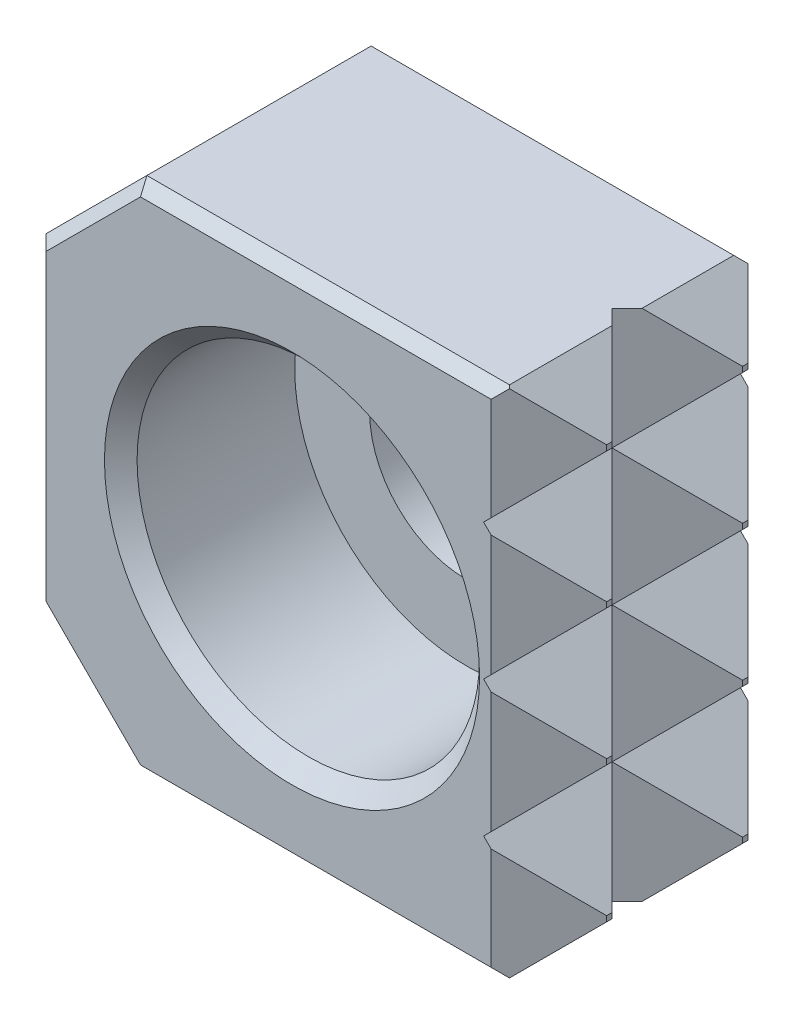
ISO-10303-21;
HEADER;
FILE_DESCRIPTION(('STEP AP214'),'2;1');
FILE_NAME('part.step','',(''),(''),'','','');
FILE_SCHEMA(('AUTOMOTIVE_DESIGN { 1 0 10303 214 1 1 1 1 }'));
ENDSEC;
DATA;
#1=APPLICATION_CONTEXT('core data for automotive mechanical design processes');
#2=APPLICATION_PROTOCOL_DEFINITION('international standard','automotive_design',2000,#1);
#3=PRODUCT_CONTEXT('',#1,'mechanical');
#4=PRODUCT('Part','Part','',(#3));
#5=PRODUCT_RELATED_PRODUCT_CATEGORY('part','',(#4));
#6=PRODUCT_DEFINITION_FORMATION('','',#4);
#7=PRODUCT_DEFINITION_CONTEXT('part definition',#1,'design');
#8=PRODUCT_DEFINITION('design','',#6,#7);
#9=PRODUCT_DEFINITION_SHAPE('','',#8);
#10=(LENGTH_UNIT() NAMED_UNIT(*) SI_UNIT(.MILLI.,.METRE.));
#11=(NAMED_UNIT(*) PLANE_ANGLE_UNIT() SI_UNIT($,.RADIAN.));
#12=(NAMED_UNIT(*) SI_UNIT($,.STERADIAN.) SOLID_ANGLE_UNIT());
#13=UNCERTAINTY_MEASURE_WITH_UNIT(LENGTH_MEASURE(1.E-05),#10,'distance_accuracy_value','');
#14=(GEOMETRIC_REPRESENTATION_CONTEXT(3) GLOBAL_UNCERTAINTY_ASSIGNED_CONTEXT((#13)) GLOBAL_UNIT_ASSIGNED_CONTEXT((#10,
#11,#12)) REPRESENTATION_CONTEXT('',''));
#15=CARTESIAN_POINT('',(0.,0.,0.));
#16=DIRECTION('',(0.,0.,1.));
#17=DIRECTION('',(1.,0.,0.));
#18=AXIS2_PLACEMENT_3D('',#15,#16,#17);
#19=CARTESIAN_POINT('',(6.,-6.,6.));
#20=DIRECTION('',(-1.,0.,0.));
#21=DIRECTION('',(0.,0.,-1.));
#22=AXIS2_PLACEMENT_3D('',#19,#20,#21);
#23=PLANE('',#22);
#24=DIRECTION('',(0.,1.,0.));
#25=VECTOR('',#24,1.);
#26=CARTESIAN_POINT('',(6.,-6.,4.651));
#27=LINE('',#26,#25);
#28=CARTESIAN_POINT('',(6.,1.52400000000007,4.651));
#29=VERTEX_POINT('',#28);
#30=CARTESIAN_POINT('',(6.,1.65099999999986,4.651));
#31=VERTEX_POINT('',#30);
#32=EDGE_CURVE('E523',#29,#31,#27,.T.);
#33=ORIENTED_EDGE('',*,*,#32,.F.);
#34=DIRECTION('',(0.,0.,-1.));
#35=VECTOR('',#34,1.);
#36=CARTESIAN_POINT('',(6.,1.52400000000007,6.));
#37=LINE('',#36,#35);
#38=CARTESIAN_POINT('',(6.,1.52400000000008,4.524));
#39=VERTEX_POINT('',#38);
#40=EDGE_CURVE('E467',#29,#39,#37,.T.);
#41=ORIENTED_EDGE('',*,*,#40,.T.);
#42=DIRECTION('',(0.,-1.,0.));
#43=VECTOR('',#42,1.);
#44=CARTESIAN_POINT('',(6.,-6.,4.524));
#45=LINE('',#44,#43);
#46=CARTESIAN_POINT('',(6.,1.65099999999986,4.524));
#47=VERTEX_POINT('',#46);
#48=EDGE_CURVE('E669',#47,#39,#45,.T.);
#49=ORIENTED_EDGE('',*,*,#48,.F.);
#50=DIRECTION('',(0.,0.,1.));
#51=VECTOR('',#50,1.);
#52=CARTESIAN_POINT('',(6.,1.65099999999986,6.));
#53=LINE('',#52,#51);
#54=EDGE_CURVE('E406',#47,#31,#53,.T.);
#55=ORIENTED_EDGE('',*,*,#54,.T.);
#56=EDGE_LOOP('',(#33,#41,#49,#55));
#57=FACE_BOUND('',#56,.T.);
#58=ADVANCED_FACE('F14',(#57),#23,.F.);
#59=CARTESIAN_POINT('',(6.,-1.52400000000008,4.524));
#60=VERTEX_POINT('',#59);
#61=CARTESIAN_POINT('',(6.,-1.65099999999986,4.524));
#62=VERTEX_POINT('',#61);
#63=EDGE_CURVE('E528',#60,#62,#45,.T.);
#64=ORIENTED_EDGE('',*,*,#63,.F.);
#65=DIRECTION('',(0.,0.,1.));
#66=VECTOR('',#65,1.);
#67=CARTESIAN_POINT('',(6.,-1.52400000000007,6.));
#68=LINE('',#67,#66);
#69=CARTESIAN_POINT('',(6.,-1.52400000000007,4.651));
#70=VERTEX_POINT('',#69);
#71=EDGE_CURVE('E37',#60,#70,#68,.T.);
#72=ORIENTED_EDGE('',*,*,#71,.T.);
#73=CARTESIAN_POINT('',(6.,-1.65099999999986,4.651));
#74=VERTEX_POINT('',#73);
#75=EDGE_CURVE('E676',#74,#70,#27,.T.);
#76=ORIENTED_EDGE('',*,*,#75,.F.);
#77=DIRECTION('',(0.,0.,-1.));
#78=VECTOR('',#77,1.);
#79=CARTESIAN_POINT('',(6.,-1.65099999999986,6.));
#80=LINE('',#79,#78);
#81=EDGE_CURVE('E441',#74,#62,#80,.T.);
#82=ORIENTED_EDGE('',*,*,#81,.T.);
#83=EDGE_LOOP('',(#64,#72,#76,#82));
#84=FACE_BOUND('',#83,.T.);
#85=ADVANCED_FACE('F673',(#84),#23,.F.);
#86=CARTESIAN_POINT('',(6.,4.826,4.524));
#87=VERTEX_POINT('',#86);
#88=CARTESIAN_POINT('',(6.,4.699,4.524));
#89=VERTEX_POINT('',#88);
#90=EDGE_CURVE('E529',#87,#89,#45,.T.);
#91=ORIENTED_EDGE('',*,*,#90,.F.);
#92=DIRECTION('',(0.,0.,1.));
#93=VECTOR('',#92,1.);
#94=CARTESIAN_POINT('',(6.,4.826,6.));
#95=LINE('',#94,#93);
#96=CARTESIAN_POINT('',(6.,4.826,4.651));
#97=VERTEX_POINT('',#96);
#98=EDGE_CURVE('E383',#87,#97,#95,.T.);
#99=ORIENTED_EDGE('',*,*,#98,.T.);
#100=CARTESIAN_POINT('',(6.,4.699,4.651));
#101=VERTEX_POINT('',#100);
#102=EDGE_CURVE('E520',#101,#97,#27,.T.);
#103=ORIENTED_EDGE('',*,*,#102,.F.);
#104=DIRECTION('',(0.,0.,-1.));
#105=VECTOR('',#104,1.);
#106=CARTESIAN_POINT('',(6.,4.699,6.));
#107=LINE('',#106,#105);
#108=EDGE_CURVE('E416',#101,#89,#107,.T.);
#109=ORIENTED_EDGE('',*,*,#108,.T.);
#110=EDGE_LOOP('',(#91,#99,#103,#109));
#111=FACE_BOUND('',#110,.T.);
#112=ADVANCED_FACE('F809',(#111),#23,.F.);
#113=DIRECTION('',(0.,-1.,0.));
#114=VECTOR('',#113,1.);
#115=CARTESIAN_POINT('',(6.,-6.,1.476));
#116=LINE('',#115,#114);
#117=CARTESIAN_POINT('',(6.,1.65099999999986,1.476));
#118=VERTEX_POINT('',#117);
#119=CARTESIAN_POINT('',(6.,1.52400000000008,1.476));
#120=VERTEX_POINT('',#119);
#121=EDGE_CURVE('E1335',#118,#120,#116,.T.);
#122=ORIENTED_EDGE('',*,*,#121,.T.);
#123=DIRECTION('',(0.,0.,-1.));
#124=VECTOR('',#123,1.);
#125=CARTESIAN_POINT('',(6.,1.52400000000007,6.));
#126=LINE('',#125,#124);
#127=CARTESIAN_POINT('',(6.,1.52400000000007,1.349));
#128=VERTEX_POINT('',#127);
#129=EDGE_CURVE('E464',#120,#128,#126,.T.);
#130=ORIENTED_EDGE('',*,*,#129,.T.);
#131=DIRECTION('',(0.,1.,0.));
#132=VECTOR('',#131,1.);
#133=CARTESIAN_POINT('',(6.,-6.,1.349));
#134=LINE('',#133,#132);
#135=CARTESIAN_POINT('',(6.,1.65099999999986,1.349));
#136=VERTEX_POINT('',#135);
#137=EDGE_CURVE('E518',#128,#136,#134,.T.);
#138=ORIENTED_EDGE('',*,*,#137,.T.);
#139=DIRECTION('',(0.,0.,1.));
#140=VECTOR('',#139,1.);
#141=CARTESIAN_POINT('',(6.,1.65099999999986,6.));
#142=LINE('',#141,#140);
#143=EDGE_CURVE('E403',#136,#118,#142,.T.);
#144=ORIENTED_EDGE('',*,*,#143,.T.);
#145=EDGE_LOOP('',(#122,#130,#138,#144));
#146=FACE_BOUND('',#145,.T.);
#147=ADVANCED_FACE('F1206',(#146),#23,.F.);
#148=CARTESIAN_POINT('',(6.,-1.65099999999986,1.349));
#149=VERTEX_POINT('',#148);
#150=CARTESIAN_POINT('',(6.,-1.52400000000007,1.349));
#151=VERTEX_POINT('',#150);
#152=EDGE_CURVE('E1340',#149,#151,#134,.T.);
#153=ORIENTED_EDGE('',*,*,#152,.T.);
#154=DIRECTION('',(0.,0.,1.));
#155=VECTOR('',#154,1.);
#156=CARTESIAN_POINT('',(6.,-1.52400000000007,6.));
#157=LINE('',#156,#155);
#158=CARTESIAN_POINT('',(6.,-1.52400000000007,1.476));
#159=VERTEX_POINT('',#158);
#160=EDGE_CURVE('E452',#151,#159,#157,.T.);
#161=ORIENTED_EDGE('',*,*,#160,.T.);
#162=CARTESIAN_POINT('',(6.,-1.65099999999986,1.476));
#163=VERTEX_POINT('',#162);
#164=EDGE_CURVE('E533',#159,#163,#116,.T.);
#165=ORIENTED_EDGE('',*,*,#164,.T.);
#166=DIRECTION('',(0.,0.,-1.));
#167=VECTOR('',#166,1.);
#168=CARTESIAN_POINT('',(6.,-1.65099999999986,6.));
#169=LINE('',#168,#167);
#170=EDGE_CURVE('E438',#163,#149,#169,.T.);
#171=ORIENTED_EDGE('',*,*,#170,.T.);
#172=EDGE_LOOP('',(#153,#161,#165,#171));
#173=FACE_BOUND('',#172,.T.);
#174=ADVANCED_FACE('F1161',(#173),#23,.F.);
#175=CARTESIAN_POINT('',(6.,4.699,1.349));
#176=VERTEX_POINT('',#175);
#177=CARTESIAN_POINT('',(6.,4.826,1.349));
#178=VERTEX_POINT('',#177);
#179=EDGE_CURVE('E514',#176,#178,#134,.T.);
#180=ORIENTED_EDGE('',*,*,#179,.T.);
#181=DIRECTION('',(0.,0.,1.));
#182=VECTOR('',#181,1.);
#183=CARTESIAN_POINT('',(6.,4.826,6.));
#184=LINE('',#183,#182);
#185=CARTESIAN_POINT('',(6.,4.826,1.476));
#186=VERTEX_POINT('',#185);
#187=EDGE_CURVE('E394',#178,#186,#184,.T.);
#188=ORIENTED_EDGE('',*,*,#187,.T.);
#189=CARTESIAN_POINT('',(6.,4.699,1.476));
#190=VERTEX_POINT('',#189);
#191=EDGE_CURVE('E534',#186,#190,#116,.T.);
#192=ORIENTED_EDGE('',*,*,#191,.T.);
#193=DIRECTION('',(0.,0.,-1.));
#194=VECTOR('',#193,1.);
#195=CARTESIAN_POINT('',(6.,4.699,6.));
#196=LINE('',#195,#194);
#197=EDGE_CURVE('E413',#190,#176,#196,.T.);
#198=ORIENTED_EDGE('',*,*,#197,.T.);
#199=EDGE_LOOP('',(#180,#188,#192,#198));
#200=FACE_BOUND('',#199,.T.);
#201=ADVANCED_FACE('F817',(#200),#23,.F.);
#202=CARTESIAN_POINT('',(6.0635,6.,1.4125));
#203=DIRECTION('',(-0.707106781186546,0.,0.707106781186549));
#204=DIRECTION('',(-0.707106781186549,0.,-0.707106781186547));
#205=AXIS2_PLACEMENT_3D('',#202,#203,#204);
#206=PLANE('',#205);
#207=ORIENTED_EDGE('',*,*,#137,.F.);
#208=DIRECTION('',(-0.577350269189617,-0.577350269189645,-0.577350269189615));
#209=VECTOR('',#208,1.);
#210=CARTESIAN_POINT('',(7.53433333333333,3.05833333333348,2.88333333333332));
#211=LINE('',#210,#209);
#212=CARTESIAN_POINT('',(4.651,0.175000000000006,0.));
#213=VERTEX_POINT('',#212);
#214=EDGE_CURVE('E472',#128,#213,#211,.T.);
#215=ORIENTED_EDGE('',*,*,#214,.T.);
#216=DIRECTION('',(0.,1.,0.));
#217=VECTOR('',#216,1.);
#218=CARTESIAN_POINT('',(4.651,6.,0.));
#219=LINE('',#218,#217);
#220=CARTESIAN_POINT('',(4.651,3.,0.));
#221=VERTEX_POINT('',#220);
#222=EDGE_CURVE('E901',#213,#221,#219,.T.);
#223=ORIENTED_EDGE('',*,*,#222,.T.);
#224=DIRECTION('',(0.577350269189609,-0.577350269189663,0.577350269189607));
#225=VECTOR('',#224,1.);
#226=CARTESIAN_POINT('',(4.59266666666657,3.05833333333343,-0.0583333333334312));
#227=LINE('',#226,#225);
#228=EDGE_CURVE('E309',#221,#136,#227,.T.);
#229=ORIENTED_EDGE('',*,*,#228,.T.);
#230=EDGE_LOOP('',(#207,#215,#223,#229));
#231=FACE_BOUND('',#230,.T.);
#232=ADVANCED_FACE('F1139',(#231),#206,.F.);
#233=CARTESIAN_POINT('',(4.651,-3.,0.));
#234=VERTEX_POINT('',#233);
#235=CARTESIAN_POINT('',(4.651,-0.175000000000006,0.));
#236=VERTEX_POINT('',#235);
#237=EDGE_CURVE('E545',#234,#236,#219,.T.);
#238=ORIENTED_EDGE('',*,*,#237,.T.);
#239=DIRECTION('',(0.577350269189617,-0.577350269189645,0.577350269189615));
#240=VECTOR('',#239,1.);
#241=CARTESIAN_POINT('',(3.53433333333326,0.941666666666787,-1.11666666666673));
#242=LINE('',#241,#240);
#243=EDGE_CURVE('E458',#236,#151,#242,.T.);
#244=ORIENTED_EDGE('',*,*,#243,.T.);
#245=ORIENTED_EDGE('',*,*,#152,.F.);
#246=DIRECTION('',(-0.577350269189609,-0.577350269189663,-0.577350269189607));
#247=VECTOR('',#246,1.);
#248=CARTESIAN_POINT('',(8.5926666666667,0.941666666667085,3.94166666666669));
#249=LINE('',#248,#247);
#250=EDGE_CURVE('E446',#149,#234,#249,.T.);
#251=ORIENTED_EDGE('',*,*,#250,.T.);
#252=EDGE_LOOP('',(#238,#244,#245,#251));
#253=FACE_BOUND('',#252,.T.);
#254=ADVANCED_FACE('F1134',(#253),#206,.F.);
#255=DIRECTION('',(-0.577350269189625,-0.577350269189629,-0.577350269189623));
#256=VECTOR('',#255,1.);
#257=CARTESIAN_POINT('',(5.10066666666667,5.94166666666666,0.449666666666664));
#258=LINE('',#257,#256);
#259=CARTESIAN_POINT('',(4.651,5.492,0.));
#260=VERTEX_POINT('',#259);
#261=CARTESIAN_POINT('',(4.9925,5.8335,0.3415));
#262=VERTEX_POINT('',#261);
#263=EDGE_CURVE('E586',#260,#262,#258,.F.);
#264=ORIENTED_EDGE('',*,*,#263,.T.);
#265=DIRECTION('',(0.577350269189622,-0.577350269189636,0.57735026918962));
#266=VECTOR('',#265,1.);
#267=CARTESIAN_POINT('',(5.651,5.175,0.999999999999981));
#268=LINE('',#267,#266);
#269=EDGE_CURVE('E391',#262,#178,#268,.T.);
#270=ORIENTED_EDGE('',*,*,#269,.T.);
#271=ORIENTED_EDGE('',*,*,#179,.F.);
#272=DIRECTION('',(-0.577350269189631,-0.577350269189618,-0.577350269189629));
#273=VECTOR('',#272,1.);
#274=CARTESIAN_POINT('',(6.476,5.175,1.825));
#275=LINE('',#274,#273);
#276=CARTESIAN_POINT('',(4.651,3.35,0.));
#277=VERTEX_POINT('',#276);
#278=EDGE_CURVE('E421',#176,#277,#275,.T.);
#279=ORIENTED_EDGE('',*,*,#278,.T.);
#280=EDGE_CURVE('E320',#277,#260,#219,.T.);
#281=ORIENTED_EDGE('',*,*,#280,.T.);
#282=EDGE_LOOP('',(#264,#270,#271,#279,#281));
#283=FACE_BOUND('',#282,.T.);
#284=ADVANCED_FACE('F900',(#283),#206,.F.);
#285=CARTESIAN_POINT('',(6.0635,6.,4.5875));
#286=DIRECTION('',(0.707106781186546,0.,0.707106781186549));
#287=DIRECTION('',(-0.707106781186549,0.,0.707106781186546));
#288=AXIS2_PLACEMENT_3D('',#285,#286,#287);
#289=PLANE('',#288);
#290=DIRECTION('',(-0.577350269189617,-0.577350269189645,0.577350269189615));
#291=VECTOR('',#290,1.);
#292=CARTESIAN_POINT('',(7.53433333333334,3.05833333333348,3.11666666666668));
#293=LINE('',#292,#291);
#294=CARTESIAN_POINT('',(4.651,0.175000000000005,6.));
#295=VERTEX_POINT('',#294);
#296=EDGE_CURVE('E470',#29,#295,#293,.T.);
#297=ORIENTED_EDGE('',*,*,#296,.F.);
#298=ORIENTED_EDGE('',*,*,#32,.T.);
#299=DIRECTION('',(0.577350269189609,-0.577350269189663,-0.577350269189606));
#300=VECTOR('',#299,1.);
#301=CARTESIAN_POINT('',(4.59266666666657,3.05833333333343,6.05833333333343));
#302=LINE('',#301,#300);
#303=CARTESIAN_POINT('',(4.651,3.,6.));
#304=VERTEX_POINT('',#303);
#305=EDGE_CURVE('E409',#304,#31,#302,.T.);
#306=ORIENTED_EDGE('',*,*,#305,.F.);
#307=DIRECTION('',(0.,-1.,0.));
#308=VECTOR('',#307,1.);
#309=CARTESIAN_POINT('',(4.651,6.,6.));
#310=LINE('',#309,#308);
#311=EDGE_CURVE('E550',#304,#295,#310,.T.);
#312=ORIENTED_EDGE('',*,*,#311,.T.);
#313=EDGE_LOOP('',(#297,#298,#306,#312));
#314=FACE_BOUND('',#313,.T.);
#315=ADVANCED_FACE('F724',(#314),#289,.T.);
#316=DIRECTION('',(0.577350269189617,-0.577350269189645,-0.577350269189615));
#317=VECTOR('',#316,1.);
#318=CARTESIAN_POINT('',(3.53433333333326,0.941666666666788,7.11666666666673));
#319=LINE('',#318,#317);
#320=CARTESIAN_POINT('',(4.651,-0.175000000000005,6.));
#321=VERTEX_POINT('',#320);
#322=EDGE_CURVE('E456',#321,#70,#319,.T.);
#323=ORIENTED_EDGE('',*,*,#322,.F.);
#324=CARTESIAN_POINT('',(4.651,-3.,6.));
#325=VERTEX_POINT('',#324);
#326=EDGE_CURVE('E686',#321,#325,#310,.T.);
#327=ORIENTED_EDGE('',*,*,#326,.T.);
#328=DIRECTION('',(-0.577350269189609,-0.577350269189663,0.577350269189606));
#329=VECTOR('',#328,1.);
#330=CARTESIAN_POINT('',(8.5926666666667,0.941666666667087,2.05833333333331));
#331=LINE('',#330,#329);
#332=EDGE_CURVE('E444',#74,#325,#331,.T.);
#333=ORIENTED_EDGE('',*,*,#332,.F.);
#334=ORIENTED_EDGE('',*,*,#75,.T.);
#335=EDGE_LOOP('',(#323,#327,#333,#334));
#336=FACE_BOUND('',#335,.T.);
#337=ADVANCED_FACE('F684',(#336),#289,.T.);
#338=DIRECTION('',(0.577350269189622,-0.577350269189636,-0.577350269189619));
#339=VECTOR('',#338,1.);
#340=CARTESIAN_POINT('',(5.651,5.175,5.));
#341=LINE('',#340,#339);
#342=CARTESIAN_POINT('',(4.8655,5.9605,5.7855));
#343=VERTEX_POINT('',#342);
#344=EDGE_CURVE('E379',#343,#97,#341,.T.);
#345=ORIENTED_EDGE('',*,*,#344,.F.);
#346=DIRECTION('',(-0.57735026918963,-0.577350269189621,0.577350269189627));
#347=VECTOR('',#346,1.);
#348=CARTESIAN_POINT('',(5.67733333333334,6.77233333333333,4.97366666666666));
#349=LINE('',#348,#347);
#350=CARTESIAN_POINT('',(4.651,5.746,6.));
#351=VERTEX_POINT('',#350);
#352=EDGE_CURVE('E614',#343,#351,#349,.T.);
#353=ORIENTED_EDGE('',*,*,#352,.T.);
#354=CARTESIAN_POINT('',(4.651,3.35,6.));
#355=VERTEX_POINT('',#354);
#356=EDGE_CURVE('E546',#351,#355,#310,.T.);
#357=ORIENTED_EDGE('',*,*,#356,.T.);
#358=DIRECTION('',(-0.577350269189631,-0.577350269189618,0.577350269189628));
#359=VECTOR('',#358,1.);
#360=CARTESIAN_POINT('',(6.476,5.175,4.175));
#361=LINE('',#360,#359);
#362=EDGE_CURVE('E419',#101,#355,#361,.T.);
#363=ORIENTED_EDGE('',*,*,#362,.F.);
#364=ORIENTED_EDGE('',*,*,#102,.T.);
#365=EDGE_LOOP('',(#345,#353,#357,#363,#364));
#366=FACE_BOUND('',#365,.T.);
#367=ADVANCED_FACE('F735',(#366),#289,.T.);
#368=CARTESIAN_POINT('',(4.476,6.,3.));
#369=DIRECTION('',(-0.707106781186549,0.,-0.707106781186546));
#370=DIRECTION('',(0.707106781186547,0.,-0.707106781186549));
#371=AXIS2_PLACEMENT_3D('',#368,#369,#370);
#372=PLANE('',#371);
#373=DIRECTION('',(0.,-1.,0.));
#374=VECTOR('',#373,1.);
#375=CARTESIAN_POINT('',(4.476,6.,3.));
#376=LINE('',#375,#374);
#377=CARTESIAN_POINT('',(4.476,3.175,3.));
#378=VERTEX_POINT('',#377);
#379=CARTESIAN_POINT('',(4.476,0.,3.));
#380=VERTEX_POINT('',#379);
#381=EDGE_CURVE('E515',#378,#380,#376,.T.);
#382=ORIENTED_EDGE('',*,*,#381,.T.);
#383=DIRECTION('',(0.577350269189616,0.577350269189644,-0.577350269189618));
#384=VECTOR('',#383,1.);
#385=CARTESIAN_POINT('',(6.476,2.00000000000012,0.999999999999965));
#386=LINE('',#385,#384);
#387=EDGE_CURVE('E461',#380,#120,#386,.T.);
#388=ORIENTED_EDGE('',*,*,#387,.T.);
#389=ORIENTED_EDGE('',*,*,#121,.F.);
#390=DIRECTION('',(-0.577350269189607,0.577350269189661,0.577350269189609));
#391=VECTOR('',#390,1.);
#392=CARTESIAN_POINT('',(3.53433333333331,4.11666666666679,3.94166666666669));
#393=LINE('',#392,#391);
#394=EDGE_CURVE('E400',#118,#378,#393,.T.);
#395=ORIENTED_EDGE('',*,*,#394,.T.);
#396=EDGE_LOOP('',(#382,#388,#389,#395));
#397=FACE_BOUND('',#396,.T.);
#398=ADVANCED_FACE('F660',(#397),#372,.F.);
#399=ORIENTED_EDGE('',*,*,#164,.F.);
#400=DIRECTION('',(-0.577350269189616,0.577350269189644,0.577350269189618));
#401=VECTOR('',#400,1.);
#402=CARTESIAN_POINT('',(2.47599999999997,2.00000000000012,5.));
#403=LINE('',#402,#401);
#404=EDGE_CURVE('E449',#159,#380,#403,.T.);
#405=ORIENTED_EDGE('',*,*,#404,.T.);
#406=CARTESIAN_POINT('',(4.476,-3.175,3.));
#407=VERTEX_POINT('',#406);
#408=EDGE_CURVE('E652',#380,#407,#376,.T.);
#409=ORIENTED_EDGE('',*,*,#408,.T.);
#410=DIRECTION('',(0.577350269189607,0.577350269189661,-0.577350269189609));
#411=VECTOR('',#410,1.);
#412=CARTESIAN_POINT('',(7.53433333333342,-0.116666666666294,-0.0583333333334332));
#413=LINE('',#412,#411);
#414=EDGE_CURVE('E435',#407,#163,#413,.T.);
#415=ORIENTED_EDGE('',*,*,#414,.T.);
#416=EDGE_LOOP('',(#399,#405,#409,#415));
#417=FACE_BOUND('',#416,.T.);
#418=ADVANCED_FACE('F651',(#417),#372,.F.);
#419=ORIENTED_EDGE('',*,*,#191,.F.);
#420=DIRECTION('',(-0.577350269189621,0.577350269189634,0.577350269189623));
#421=VECTOR('',#420,1.);
#422=CARTESIAN_POINT('',(4.59266666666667,6.23333333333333,2.88333333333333));
#423=LINE('',#422,#421);
#424=CARTESIAN_POINT('',(4.826,6.,2.65));
#425=VERTEX_POINT('',#424);
#426=EDGE_CURVE('E397',#186,#425,#423,.T.);
#427=ORIENTED_EDGE('',*,*,#426,.T.);
#428=DIRECTION('',(0.707106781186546,0.,-0.707106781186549));
#429=VECTOR('',#428,1.);
#430=CARTESIAN_POINT('',(4.476,6.,3.));
#431=LINE('',#430,#429);
#432=CARTESIAN_POINT('',(4.476,6.,3.));
#433=VERTEX_POINT('',#432);
#434=EDGE_CURVE('E504',#433,#425,#431,.T.);
#435=ORIENTED_EDGE('',*,*,#434,.F.);
#436=EDGE_CURVE('E511',#433,#378,#376,.T.);
#437=ORIENTED_EDGE('',*,*,#436,.T.);
#438=DIRECTION('',(0.577350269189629,0.577350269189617,-0.577350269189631));
#439=VECTOR('',#438,1.);
#440=CARTESIAN_POINT('',(5.41766666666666,4.11666666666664,2.05833333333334));
#441=LINE('',#440,#439);
#442=EDGE_CURVE('E299',#378,#190,#441,.T.);
#443=ORIENTED_EDGE('',*,*,#442,.T.);
#444=EDGE_LOOP('',(#419,#427,#435,#437,#443));
#445=FACE_BOUND('',#444,.T.);
#446=ADVANCED_FACE('F833',(#445),#372,.F.);
#447=CARTESIAN_POINT('',(4.476,6.,3.));
#448=DIRECTION('',(0.707106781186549,0.,-0.707106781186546));
#449=DIRECTION('',(0.707106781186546,0.,0.707106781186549));
#450=AXIS2_PLACEMENT_3D('',#447,#448,#449);
#451=PLANE('',#450);
#452=DIRECTION('',(0.577350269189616,0.577350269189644,0.577350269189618));
#453=VECTOR('',#452,1.);
#454=CARTESIAN_POINT('',(6.476,2.00000000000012,5.));
#455=LINE('',#454,#453);
#456=EDGE_CURVE('E9',#380,#39,#455,.T.);
#457=ORIENTED_EDGE('',*,*,#456,.F.);
#458=ORIENTED_EDGE('',*,*,#381,.F.);
#459=DIRECTION('',(-0.577350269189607,0.577350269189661,-0.577350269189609));
#460=VECTOR('',#459,1.);
#461=CARTESIAN_POINT('',(3.53433333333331,4.11666666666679,2.0583333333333));
#462=LINE('',#461,#460);
#463=EDGE_CURVE('E632',#47,#378,#462,.T.);
#464=ORIENTED_EDGE('',*,*,#463,.F.);
#465=ORIENTED_EDGE('',*,*,#48,.T.);
#466=EDGE_LOOP('',(#457,#458,#464,#465));
#467=FACE_BOUND('',#466,.T.);
#468=ADVANCED_FACE('F667',(#467),#451,.T.);
#469=DIRECTION('',(-0.577350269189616,0.577350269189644,-0.577350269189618));
#470=VECTOR('',#469,1.);
#471=CARTESIAN_POINT('',(2.47599999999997,2.00000000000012,0.999999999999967));
#472=LINE('',#471,#470);
#473=EDGE_CURVE('E22',#60,#380,#472,.T.);
#474=ORIENTED_EDGE('',*,*,#473,.F.);
#475=ORIENTED_EDGE('',*,*,#63,.T.);
#476=DIRECTION('',(0.577350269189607,0.577350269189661,0.577350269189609));
#477=VECTOR('',#476,1.);
#478=CARTESIAN_POINT('',(7.53433333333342,-0.116666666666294,6.05833333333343));
#479=LINE('',#478,#477);
#480=EDGE_CURVE('E638',#407,#62,#479,.T.);
#481=ORIENTED_EDGE('',*,*,#480,.F.);
#482=ORIENTED_EDGE('',*,*,#408,.F.);
#483=EDGE_LOOP('',(#474,#475,#481,#482));
#484=FACE_BOUND('',#483,.T.);
#485=ADVANCED_FACE('F657',(#484),#451,.T.);
#486=DIRECTION('',(-0.57735026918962,0.577350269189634,-0.577350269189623));
#487=VECTOR('',#486,1.);
#488=CARTESIAN_POINT('',(4.59266666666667,6.23333333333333,3.11666666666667));
#489=LINE('',#488,#487);
#490=CARTESIAN_POINT('',(4.826,6.,3.35));
#491=VERTEX_POINT('',#490);
#492=EDGE_CURVE('E387',#87,#491,#489,.T.);
#493=ORIENTED_EDGE('',*,*,#492,.F.);
#494=ORIENTED_EDGE('',*,*,#90,.T.);
#495=DIRECTION('',(0.577350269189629,0.577350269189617,0.577350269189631));
#496=VECTOR('',#495,1.);
#497=CARTESIAN_POINT('',(5.41766666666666,4.11666666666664,3.94166666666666));
#498=LINE('',#497,#496);
#499=EDGE_CURVE('E634',#378,#89,#498,.T.);
#500=ORIENTED_EDGE('',*,*,#499,.F.);
#501=ORIENTED_EDGE('',*,*,#436,.F.);
#502=DIRECTION('',(0.707106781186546,0.,0.707106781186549));
#503=VECTOR('',#502,1.);
#504=CARTESIAN_POINT('',(4.476,6.,3.));
#505=LINE('',#504,#503);
#506=EDGE_CURVE('E507',#433,#491,#505,.T.);
#507=ORIENTED_EDGE('',*,*,#506,.T.);
#508=EDGE_LOOP('',(#493,#494,#500,#501,#507));
#509=FACE_BOUND('',#508,.T.);
#510=ADVANCED_FACE('F811',(#509),#451,.T.);
#511=CARTESIAN_POINT('',(6.,-4.699,4.524));
#512=VERTEX_POINT('',#511);
#513=CARTESIAN_POINT('',(6.,-4.826,4.524));
#514=VERTEX_POINT('',#513);
#515=EDGE_CURVE('E525',#512,#514,#45,.T.);
#516=ORIENTED_EDGE('',*,*,#515,.F.);
#517=DIRECTION('',(0.,0.,1.));
#518=VECTOR('',#517,1.);
#519=CARTESIAN_POINT('',(6.,-4.699,6.));
#520=LINE('',#519,#518);
#521=CARTESIAN_POINT('',(6.,-4.699,4.651));
#522=VERTEX_POINT('',#521);
#523=EDGE_CURVE('E29',#512,#522,#520,.T.);
#524=ORIENTED_EDGE('',*,*,#523,.T.);
#525=CARTESIAN_POINT('',(6.,-4.826,4.651));
#526=VERTEX_POINT('',#525);
#527=EDGE_CURVE('E524',#526,#522,#27,.T.);
#528=ORIENTED_EDGE('',*,*,#527,.F.);
#529=DIRECTION('',(0.,0.,-1.));
#530=VECTOR('',#529,1.);
#531=CARTESIAN_POINT('',(6.,-4.826,6.));
#532=LINE('',#531,#530);
#533=EDGE_CURVE('E362',#526,#514,#532,.T.);
#534=ORIENTED_EDGE('',*,*,#533,.T.);
#535=EDGE_LOOP('',(#516,#524,#528,#534));
#536=FACE_BOUND('',#535,.T.);
#537=ADVANCED_FACE('F16',(#536),#23,.F.);
#538=CARTESIAN_POINT('',(6.,-4.826,1.349));
#539=VERTEX_POINT('',#538);
#540=CARTESIAN_POINT('',(6.,-4.699,1.349));
#541=VERTEX_POINT('',#540);
#542=EDGE_CURVE('E519',#539,#541,#134,.T.);
#543=ORIENTED_EDGE('',*,*,#542,.T.);
#544=DIRECTION('',(0.,0.,1.));
#545=VECTOR('',#544,1.);
#546=CARTESIAN_POINT('',(6.,-4.699,6.));
#547=LINE('',#546,#545);
#548=CARTESIAN_POINT('',(6.,-4.699,1.476));
#549=VERTEX_POINT('',#548);
#550=EDGE_CURVE('E426',#541,#549,#547,.T.);
#551=ORIENTED_EDGE('',*,*,#550,.T.);
#552=CARTESIAN_POINT('',(6.,-4.826,1.476));
#553=VERTEX_POINT('',#552);
#554=EDGE_CURVE('E530',#549,#553,#116,.T.);
#555=ORIENTED_EDGE('',*,*,#554,.T.);
#556=DIRECTION('',(0.,0.,-1.));
#557=VECTOR('',#556,1.);
#558=CARTESIAN_POINT('',(6.,-4.826,6.));
#559=LINE('',#558,#557);
#560=EDGE_CURVE('E373',#553,#539,#559,.T.);
#561=ORIENTED_EDGE('',*,*,#560,.T.);
#562=EDGE_LOOP('',(#543,#551,#555,#561));
#563=FACE_BOUND('',#562,.T.);
#564=ADVANCED_FACE('F782',(#563),#23,.F.);
#565=CARTESIAN_POINT('',(-6.,6.,6.));
#566=DIRECTION('',(0.,1.,0.));
#567=DIRECTION('',(-1.,0.,0.));
#568=AXIS2_PLACEMENT_3D('',#565,#566,#567);
#569=PLANE('',#568);
#570=DIRECTION('',(0.,0.,1.));
#571=VECTOR('',#570,1.);
#572=CARTESIAN_POINT('',(4.826,6.,6.));
#573=LINE('',#572,#571);
#574=CARTESIAN_POINT('',(4.826,6.,0.508));
#575=VERTEX_POINT('',#574);
#576=EDGE_CURVE('E384',#575,#425,#573,.T.);
#577=ORIENTED_EDGE('',*,*,#576,.F.);
#578=DIRECTION('',(-1.,0.,0.));
#579=VECTOR('',#578,1.);
#580=CARTESIAN_POINT('',(-6.,6.,0.508));
#581=LINE('',#580,#579);
#582=CARTESIAN_POINT('',(-3.64415,6.,0.508));
#583=VERTEX_POINT('',#582);
#584=EDGE_CURVE('E599',#575,#583,#581,.T.);
#585=ORIENTED_EDGE('',*,*,#584,.T.);
#586=DIRECTION('',(0.,0.,1.));
#587=VECTOR('',#586,1.);
#588=CARTESIAN_POINT('',(-3.64415,6.,6.));
#589=LINE('',#588,#587);
#590=CARTESIAN_POINT('',(-3.64415,6.,5.746));
#591=VERTEX_POINT('',#590);
#592=EDGE_CURVE('E557',#583,#591,#589,.T.);
#593=ORIENTED_EDGE('',*,*,#592,.T.);
#594=DIRECTION('',(1.,0.,0.));
#595=VECTOR('',#594,1.);
#596=CARTESIAN_POINT('',(4.651,6.,5.746));
#597=LINE('',#596,#595);
#598=CARTESIAN_POINT('',(4.826,6.,5.746));
#599=VERTEX_POINT('',#598);
#600=EDGE_CURVE('E625',#591,#599,#597,.T.);
#601=ORIENTED_EDGE('',*,*,#600,.T.);
#602=EDGE_CURVE('E381',#491,#599,#573,.T.);
#603=ORIENTED_EDGE('',*,*,#602,.F.);
#604=ORIENTED_EDGE('',*,*,#506,.F.);
#605=ORIENTED_EDGE('',*,*,#434,.T.);
#606=EDGE_LOOP('',(#577,#585,#593,#601,#603,#604,#605));
#607=FACE_BOUND('',#606,.T.);
#608=ADVANCED_FACE('F816',(#607),#569,.T.);
#609=CARTESIAN_POINT('',(6.,-6.,6.));
#610=DIRECTION('',(0.,-1.,0.));
#611=DIRECTION('',(1.,0.,0.));
#612=AXIS2_PLACEMENT_3D('',#609,#610,#611);
#613=PLANE('',#612);
#614=DIRECTION('',(0.,0.,-1.));
#615=VECTOR('',#614,1.);
#616=CARTESIAN_POINT('',(4.826,-6.,6.));
#617=LINE('',#616,#615);
#618=CARTESIAN_POINT('',(4.826,-6.,5.746));
#619=VERTEX_POINT('',#618);
#620=CARTESIAN_POINT('',(4.826,-6.,3.35));
#621=VERTEX_POINT('',#620);
#622=EDGE_CURVE('E360',#619,#621,#617,.T.);
#623=ORIENTED_EDGE('',*,*,#622,.F.);
#624=DIRECTION('',(-1.,0.,0.));
#625=VECTOR('',#624,1.);
#626=CARTESIAN_POINT('',(-3.64415,-6.,5.746));
#627=LINE('',#626,#625);
#628=CARTESIAN_POINT('',(-3.64415,-6.,5.746));
#629=VERTEX_POINT('',#628);
#630=EDGE_CURVE('E601',#619,#629,#627,.T.);
#631=ORIENTED_EDGE('',*,*,#630,.T.);
#632=DIRECTION('',(0.,0.,-1.));
#633=VECTOR('',#632,1.);
#634=CARTESIAN_POINT('',(-3.64415,-6.,0.));
#635=LINE('',#634,#633);
#636=CARTESIAN_POINT('',(-3.64415,-6.,0.508));
#637=VERTEX_POINT('',#636);
#638=EDGE_CURVE('E549',#629,#637,#635,.T.);
#639=ORIENTED_EDGE('',*,*,#638,.T.);
#640=DIRECTION('',(1.,0.,0.));
#641=VECTOR('',#640,1.);
#642=CARTESIAN_POINT('',(6.,-6.,0.508));
#643=LINE('',#642,#641);
#644=CARTESIAN_POINT('',(4.826,-6.,0.508));
#645=VERTEX_POINT('',#644);
#646=EDGE_CURVE('E583',#637,#645,#643,.T.);
#647=ORIENTED_EDGE('',*,*,#646,.T.);
#648=CARTESIAN_POINT('',(4.826,-6.,2.65));
#649=VERTEX_POINT('',#648);
#650=EDGE_CURVE('E363',#649,#645,#617,.T.);
#651=ORIENTED_EDGE('',*,*,#650,.F.);
#652=DIRECTION('',(0.707106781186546,0.,-0.707106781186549));
#653=VECTOR('',#652,1.);
#654=CARTESIAN_POINT('',(4.476,-6.,3.));
#655=LINE('',#654,#653);
#656=CARTESIAN_POINT('',(4.476,-6.,3.));
#657=VERTEX_POINT('',#656);
#658=EDGE_CURVE('E498',#657,#649,#655,.T.);
#659=ORIENTED_EDGE('',*,*,#658,.F.);
#660=DIRECTION('',(0.707106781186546,0.,0.707106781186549));
#661=VECTOR('',#660,1.);
#662=CARTESIAN_POINT('',(4.476,-6.,3.));
#663=LINE('',#662,#661);
#664=EDGE_CURVE('E501',#657,#621,#663,.T.);
#665=ORIENTED_EDGE('',*,*,#664,.T.);
#666=EDGE_LOOP('',(#623,#631,#639,#647,#651,#659,#665));
#667=FACE_BOUND('',#666,.T.);
#668=ADVANCED_FACE('F709',(#667),#613,.T.);
#669=CARTESIAN_POINT('',(6.,6.,6.));
#670=DIRECTION('',(0.,0.,-1.));
#671=DIRECTION('',(1.,0.,0.));
#672=AXIS2_PLACEMENT_3D('',#669,#670,#671);
#673=PLANE('',#672);
#674=CARTESIAN_POINT('',(0.,0.,6.));
#675=DIRECTION('',(0.,0.,-1.));
#676=DIRECTION('',(1.,0.,0.));
#677=AXIS2_PLACEMENT_3D('',#674,#675,#676);
#678=CIRCLE('',#677,4.381);
#679=CARTESIAN_POINT('',(4.381,0.,6.));
#680=VERTEX_POINT('',#679);
#681=EDGE_CURVE('E563',#680,#680,#678,.T.);
#682=ORIENTED_EDGE('',*,*,#681,.T.);
#683=EDGE_LOOP('',(#682));
#684=FACE_BOUND('',#683,.T.);
#685=DIRECTION('',(-0.707106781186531,0.707106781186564,0.));
#686=VECTOR('',#685,1.);
#687=CARTESIAN_POINT('',(4.476,0.,6.));
#688=LINE('',#687,#686);
#689=CARTESIAN_POINT('',(4.476,0.,6.));
#690=VERTEX_POINT('',#689);
#691=EDGE_CURVE('E303',#321,#690,#688,.T.);
#692=ORIENTED_EDGE('',*,*,#691,.T.);
#693=DIRECTION('',(0.707106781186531,0.707106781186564,0.));
#694=VECTOR('',#693,1.);
#695=CARTESIAN_POINT('',(4.476,0.,6.));
#696=LINE('',#695,#694);
#697=EDGE_CURVE('E332',#690,#295,#696,.T.);
#698=ORIENTED_EDGE('',*,*,#697,.T.);
#699=ORIENTED_EDGE('',*,*,#311,.F.);
#700=DIRECTION('',(-0.707106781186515,0.707106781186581,0.));
#701=VECTOR('',#700,1.);
#702=CARTESIAN_POINT('',(6.06349999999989,1.58749999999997,6.));
#703=LINE('',#702,#701);
#704=CARTESIAN_POINT('',(4.476,3.175,6.));
#705=VERTEX_POINT('',#704);
#706=EDGE_CURVE('E335',#304,#705,#703,.T.);
#707=ORIENTED_EDGE('',*,*,#706,.T.);
#708=DIRECTION('',(0.707106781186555,0.70710678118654,0.));
#709=VECTOR('',#708,1.);
#710=CARTESIAN_POINT('',(4.476,3.175,6.));
#711=LINE('',#710,#709);
#712=EDGE_CURVE('E338',#705,#355,#711,.T.);
#713=ORIENTED_EDGE('',*,*,#712,.T.);
#714=ORIENTED_EDGE('',*,*,#356,.F.);
#715=DIRECTION('',(-1.,0.,0.));
#716=VECTOR('',#715,1.);
#717=CARTESIAN_POINT('',(-3.64415,5.746,6.));
#718=LINE('',#717,#716);
#719=CARTESIAN_POINT('',(-3.53893975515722,5.746,6.));
#720=VERTEX_POINT('',#719);
#721=EDGE_CURVE('E603',#351,#720,#718,.T.);
#722=ORIENTED_EDGE('',*,*,#721,.T.);
#723=DIRECTION('',(-0.707106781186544,-0.707106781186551,0.));
#724=VECTOR('',#723,1.);
#725=CARTESIAN_POINT('',(-5.82039487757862,3.46454487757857,6.));
#726=LINE('',#725,#724);
#727=CARTESIAN_POINT('',(-5.746,3.5389397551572,6.));
#728=VERTEX_POINT('',#727);
#729=EDGE_CURVE('E605',#720,#728,#726,.T.);
#730=ORIENTED_EDGE('',*,*,#729,.T.);
#731=DIRECTION('',(0.,-1.,0.));
#732=VECTOR('',#731,1.);
#733=CARTESIAN_POINT('',(-5.746,6.,6.));
#734=LINE('',#733,#732);
#735=CARTESIAN_POINT('',(-5.746,-3.5389397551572,6.));
#736=VERTEX_POINT('',#735);
#737=EDGE_CURVE('E607',#728,#736,#734,.T.);
#738=ORIENTED_EDGE('',*,*,#737,.T.);
#739=DIRECTION('',(0.707106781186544,-0.707106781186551,0.));
#740=VECTOR('',#739,1.);
#741=CARTESIAN_POINT('',(-3.4645448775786,-5.82039487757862,6.));
#742=LINE('',#741,#740);
#743=CARTESIAN_POINT('',(-3.53893975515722,-5.746,6.));
#744=VERTEX_POINT('',#743);
#745=EDGE_CURVE('E609',#736,#744,#742,.T.);
#746=ORIENTED_EDGE('',*,*,#745,.T.);
#747=DIRECTION('',(1.,0.,0.));
#748=VECTOR('',#747,1.);
#749=CARTESIAN_POINT('',(4.651,-5.746,6.));
#750=LINE('',#749,#748);
#751=CARTESIAN_POINT('',(4.651,-5.746,6.));
#752=VERTEX_POINT('',#751);
#753=EDGE_CURVE('E611',#744,#752,#750,.T.);
#754=ORIENTED_EDGE('',*,*,#753,.T.);
#755=CARTESIAN_POINT('',(4.651,-3.35,6.));
#756=VERTEX_POINT('',#755);
#757=EDGE_CURVE('E544',#756,#752,#310,.T.);
#758=ORIENTED_EDGE('',*,*,#757,.F.);
#759=DIRECTION('',(-0.707106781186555,0.70710678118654,0.));
#760=VECTOR('',#759,1.);
#761=CARTESIAN_POINT('',(4.476,-3.175,6.));
#762=LINE('',#761,#760);
#763=CARTESIAN_POINT('',(4.476,-3.175,6.));
#764=VERTEX_POINT('',#763);
#765=EDGE_CURVE('E341',#756,#764,#762,.T.);
#766=ORIENTED_EDGE('',*,*,#765,.T.);
#767=DIRECTION('',(0.707106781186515,0.707106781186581,0.));
#768=VECTOR('',#767,1.);
#769=CARTESIAN_POINT('',(6.06349999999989,-1.58749999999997,6.));
#770=LINE('',#769,#768);
#771=EDGE_CURVE('E344',#764,#325,#770,.T.);
#772=ORIENTED_EDGE('',*,*,#771,.T.);
#773=ORIENTED_EDGE('',*,*,#326,.F.);
#774=EDGE_LOOP('',(#692,#698,#699,#707,#713,#714,#722,#730,#738,#746,#754,#758,#766,#772,#773));
#775=FACE_BOUND('',#774,.T.);
#776=ADVANCED_FACE('F697',(#684,#775),#673,.F.);
#777=CARTESIAN_POINT('',(-6.,6.,6.));
#778=DIRECTION('',(1.,0.,0.));
#779=DIRECTION('',(0.,0.,1.));
#780=AXIS2_PLACEMENT_3D('',#777,#778,#779);
#781=PLANE('',#780);
#782=DIRECTION('',(0.,0.,1.));
#783=VECTOR('',#782,1.);
#784=CARTESIAN_POINT('',(-6.,-3.64415,6.));
#785=LINE('',#784,#783);
#786=CARTESIAN_POINT('',(-6.,-3.64415,0.508));
#787=VERTEX_POINT('',#786);
#788=CARTESIAN_POINT('',(-6.,-3.64415,5.746));
#789=VERTEX_POINT('',#788);
#790=EDGE_CURVE('E554',#787,#789,#785,.T.);
#791=ORIENTED_EDGE('',*,*,#790,.T.);
#792=DIRECTION('',(0.,1.,0.));
#793=VECTOR('',#792,1.);
#794=CARTESIAN_POINT('',(-6.,6.,5.746));
#795=LINE('',#794,#793);
#796=CARTESIAN_POINT('',(-6.,3.64415,5.746));
#797=VERTEX_POINT('',#796);
#798=EDGE_CURVE('E621',#789,#797,#795,.T.);
#799=ORIENTED_EDGE('',*,*,#798,.T.);
#800=DIRECTION('',(0.,0.,-1.));
#801=VECTOR('',#800,1.);
#802=CARTESIAN_POINT('',(-6.,3.64415,0.));
#803=LINE('',#802,#801);
#804=CARTESIAN_POINT('',(-6.,3.64415,0.508));
#805=VERTEX_POINT('',#804);
#806=EDGE_CURVE('E552',#797,#805,#803,.T.);
#807=ORIENTED_EDGE('',*,*,#806,.T.);
#808=DIRECTION('',(0.,-1.,0.));
#809=VECTOR('',#808,1.);
#810=CARTESIAN_POINT('',(-6.,-3.64415,0.508));
#811=LINE('',#810,#809);
#812=EDGE_CURVE('E594',#805,#787,#811,.T.);
#813=ORIENTED_EDGE('',*,*,#812,.T.);
#814=EDGE_LOOP('',(#791,#799,#807,#813));
#815=FACE_BOUND('',#814,.T.);
#816=ADVANCED_FACE('F859',(#815),#781,.F.);
#817=CARTESIAN_POINT('',(6.,6.,0.));
#818=DIRECTION('',(0.,0.,-1.));
#819=DIRECTION('',(1.,0.,0.));
#820=AXIS2_PLACEMENT_3D('',#817,#818,#819);
#821=PLANE('',#820);
#822=DIRECTION('',(0.707106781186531,0.707106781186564,0.));
#823=VECTOR('',#822,1.);
#824=CARTESIAN_POINT('',(4.476,0.,0.));
#825=LINE('',#824,#823);
#826=CARTESIAN_POINT('',(4.476,0.,0.));
#827=VERTEX_POINT('',#826);
#828=EDGE_CURVE('E313',#827,#213,#825,.T.);
#829=ORIENTED_EDGE('',*,*,#828,.F.);
#830=DIRECTION('',(-0.707106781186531,0.707106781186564,0.));
#831=VECTOR('',#830,1.);
#832=CARTESIAN_POINT('',(4.476,0.,0.));
#833=LINE('',#832,#831);
#834=EDGE_CURVE('E329',#236,#827,#833,.T.);
#835=ORIENTED_EDGE('',*,*,#834,.F.);
#836=ORIENTED_EDGE('',*,*,#237,.F.);
#837=DIRECTION('',(0.707106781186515,0.707106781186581,0.));
#838=VECTOR('',#837,1.);
#839=CARTESIAN_POINT('',(6.06349999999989,-1.58749999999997,0.));
#840=LINE('',#839,#838);
#841=CARTESIAN_POINT('',(4.476,-3.175,0.));
#842=VERTEX_POINT('',#841);
#843=EDGE_CURVE('E324',#842,#234,#840,.T.);
#844=ORIENTED_EDGE('',*,*,#843,.F.);
#845=DIRECTION('',(-0.707106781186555,0.70710678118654,0.));
#846=VECTOR('',#845,1.);
#847=CARTESIAN_POINT('',(4.476,-3.175,0.));
#848=LINE('',#847,#846);
#849=CARTESIAN_POINT('',(4.651,-3.35,0.));
#850=VERTEX_POINT('',#849);
#851=EDGE_CURVE('E321',#850,#842,#848,.T.);
#852=ORIENTED_EDGE('',*,*,#851,.F.);
#853=CARTESIAN_POINT('',(4.651,-5.492,0.));
#854=VERTEX_POINT('',#853);
#855=EDGE_CURVE('E541',#854,#850,#219,.T.);
#856=ORIENTED_EDGE('',*,*,#855,.F.);
#857=DIRECTION('',(-1.,0.,0.));
#858=VECTOR('',#857,1.);
#859=CARTESIAN_POINT('',(6.,-5.492,0.));
#860=LINE('',#859,#858);
#861=CARTESIAN_POINT('',(-3.43372951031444,-5.492,0.));
#862=VERTEX_POINT('',#861);
#863=EDGE_CURVE('E580',#854,#862,#860,.T.);
#864=ORIENTED_EDGE('',*,*,#863,.T.);
#865=DIRECTION('',(-0.707106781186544,0.707106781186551,0.));
#866=VECTOR('',#865,1.);
#867=CARTESIAN_POINT('',(-4.46286475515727,-4.46286475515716,0.));
#868=LINE('',#867,#866);
#869=CARTESIAN_POINT('',(-5.492,-3.43372951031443,0.));
#870=VERTEX_POINT('',#869);
#871=EDGE_CURVE('E578',#862,#870,#868,.T.);
#872=ORIENTED_EDGE('',*,*,#871,.T.);
#873=DIRECTION('',(0.,1.,0.));
#874=VECTOR('',#873,1.);
#875=CARTESIAN_POINT('',(-5.492,3.64415,0.));
#876=LINE('',#875,#874);
#877=CARTESIAN_POINT('',(-5.492,3.43372951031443,0.));
#878=VERTEX_POINT('',#877);
#879=EDGE_CURVE('E576',#870,#878,#876,.T.);
#880=ORIENTED_EDGE('',*,*,#879,.T.);
#881=DIRECTION('',(0.707106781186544,0.707106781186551,0.));
#882=VECTOR('',#881,1.);
#883=CARTESIAN_POINT('',(1.53713524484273,10.4628647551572,0.));
#884=LINE('',#883,#882);
#885=CARTESIAN_POINT('',(-3.43372951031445,5.492,0.));
#886=VERTEX_POINT('',#885);
#887=EDGE_CURVE('E574',#878,#886,#884,.T.);
#888=ORIENTED_EDGE('',*,*,#887,.T.);
#889=DIRECTION('',(1.,0.,0.));
#890=VECTOR('',#889,1.);
#891=CARTESIAN_POINT('',(6.,5.492,0.));
#892=LINE('',#891,#890);
#893=EDGE_CURVE('E572',#886,#260,#892,.T.);
#894=ORIENTED_EDGE('',*,*,#893,.T.);
#895=ORIENTED_EDGE('',*,*,#280,.F.);
#896=DIRECTION('',(0.707106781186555,0.70710678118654,0.));
#897=VECTOR('',#896,1.);
#898=CARTESIAN_POINT('',(4.476,3.175,0.));
#899=LINE('',#898,#897);
#900=CARTESIAN_POINT('',(4.476,3.175,0.));
#901=VERTEX_POINT('',#900);
#902=EDGE_CURVE('E296',#901,#277,#899,.T.);
#903=ORIENTED_EDGE('',*,*,#902,.F.);
#904=DIRECTION('',(-0.707106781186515,0.707106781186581,0.));
#905=VECTOR('',#904,1.);
#906=CARTESIAN_POINT('',(6.06349999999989,1.58749999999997,0.));
#907=LINE('',#906,#905);
#908=EDGE_CURVE('E306',#221,#901,#907,.T.);
#909=ORIENTED_EDGE('',*,*,#908,.F.);
#910=ORIENTED_EDGE('',*,*,#222,.F.);
#911=EDGE_LOOP('',(#829,#835,#836,#844,#852,#856,#864,#872,#880,#888,#894,#895,#903,#909,#910));
#912=FACE_BOUND('',#911,.T.);
#913=CARTESIAN_POINT('',(0.,0.,0.));
#914=DIRECTION('',(0.,0.,-1.));
#915=DIRECTION('',(1.,0.,0.));
#916=AXIS2_PLACEMENT_3D('',#913,#914,#915);
#917=CIRCLE('',#916,2.631);
#918=CARTESIAN_POINT('',(2.631,0.,0.));
#919=VERTEX_POINT('',#918);
#920=EDGE_CURVE('E566',#919,#919,#917,.F.);
#921=ORIENTED_EDGE('',*,*,#920,.T.);
#922=EDGE_LOOP('',(#921));
#923=FACE_BOUND('',#922,.T.);
#924=ADVANCED_FACE('F317',(#912,#923),#821,.T.);
#925=CARTESIAN_POINT('',(0.,0.,1.936));
#926=DIRECTION('',(0.,0.,1.));
#927=DIRECTION('',(-1.,0.,0.));
#928=AXIS2_PLACEMENT_3D('',#925,#926,#927);
#929=CYLINDRICAL_SURFACE('',#928,4.);
#930=CARTESIAN_POINT('',(0.,0.,5.619));
#931=DIRECTION('',(0.,0.,-1.));
#932=DIRECTION('',(1.,0.,0.));
#933=AXIS2_PLACEMENT_3D('',#930,#931,#932);
#934=CIRCLE('',#933,4.);
#935=CARTESIAN_POINT('',(4.,0.,5.619));
#936=VERTEX_POINT('',#935);
#937=EDGE_CURVE('E560',#936,#936,#934,.F.);
#938=ORIENTED_EDGE('',*,*,#937,.T.);
#939=EDGE_LOOP('',(#938));
#940=FACE_BOUND('',#939,.T.);
#941=CARTESIAN_POINT('',(0.,0.,1.936));
#942=DIRECTION('',(0.,0.,1.));
#943=DIRECTION('',(-1.,0.,0.));
#944=AXIS2_PLACEMENT_3D('',#941,#942,#943);
#945=CIRCLE('',#944,4.);
#946=CARTESIAN_POINT('',(-4.,0.,1.936));
#947=VERTEX_POINT('',#946);
#948=EDGE_CURVE('E538',#947,#947,#945,.T.);
#949=ORIENTED_EDGE('',*,*,#948,.F.);
#950=EDGE_LOOP('',(#949));
#951=FACE_BOUND('',#950,.T.);
#952=ADVANCED_FACE('F852',(#940,#951),#929,.F.);
#953=CARTESIAN_POINT('',(0.,0.,1.936));
#954=DIRECTION('',(0.,0.,1.));
#955=DIRECTION('',(-1.,0.,0.));
#956=AXIS2_PLACEMENT_3D('',#953,#954,#955);
#957=PLANE('',#956);
#958=CARTESIAN_POINT('',(0.,0.,1.936));
#959=DIRECTION('',(0.,0.,1.));
#960=DIRECTION('',(-1.,0.,0.));
#961=AXIS2_PLACEMENT_3D('',#958,#959,#960);
#962=CIRCLE('',#961,2.25);
#963=CARTESIAN_POINT('',(-2.25,0.,1.936));
#964=VERTEX_POINT('',#963);
#965=EDGE_CURVE('E535',#964,#964,#962,.T.);
#966=ORIENTED_EDGE('',*,*,#965,.F.);
#967=EDGE_LOOP('',(#966));
#968=FACE_BOUND('',#967,.T.);
#969=ORIENTED_EDGE('',*,*,#948,.T.);
#970=EDGE_LOOP('',(#969));
#971=FACE_BOUND('',#970,.T.);
#972=ADVANCED_FACE('F848',(#968,#971),#957,.T.);
#973=CARTESIAN_POINT('',(0.,0.,0.));
#974=DIRECTION('',(0.,0.,1.));
#975=DIRECTION('',(-1.,0.,0.));
#976=AXIS2_PLACEMENT_3D('',#973,#974,#975);
#977=CYLINDRICAL_SURFACE('',#976,2.25);
#978=CARTESIAN_POINT('',(0.,0.,0.381));
#979=DIRECTION('',(0.,0.,-1.));
#980=DIRECTION('',(1.,0.,0.));
#981=AXIS2_PLACEMENT_3D('',#978,#979,#980);
#982=CIRCLE('',#981,2.25);
#983=CARTESIAN_POINT('',(2.25,0.,0.381));
#984=VERTEX_POINT('',#983);
#985=EDGE_CURVE('E569',#984,#984,#982,.T.);
#986=ORIENTED_EDGE('',*,*,#985,.T.);
#987=EDGE_LOOP('',(#986));
#988=FACE_BOUND('',#987,.T.);
#989=ORIENTED_EDGE('',*,*,#965,.T.);
#990=EDGE_LOOP('',(#989));
#991=FACE_BOUND('',#990,.T.);
#992=ADVANCED_FACE('F845',(#988,#991),#977,.F.);
#993=ORIENTED_EDGE('',*,*,#855,.T.);
#994=DIRECTION('',(0.577350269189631,-0.577350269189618,0.577350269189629));
#995=VECTOR('',#994,1.);
#996=CARTESIAN_POINT('',(2.47600000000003,-1.17500000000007,-2.17499999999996));
#997=LINE('',#996,#995);
#998=EDGE_CURVE('E432',#850,#541,#997,.T.);
#999=ORIENTED_EDGE('',*,*,#998,.T.);
#1000=ORIENTED_EDGE('',*,*,#542,.F.);
#1001=DIRECTION('',(-0.577350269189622,-0.577350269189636,-0.57735026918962));
#1002=VECTOR('',#1001,1.);
#1003=CARTESIAN_POINT('',(9.651,-1.17499999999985,5.));
#1004=LINE('',#1003,#1002);
#1005=CARTESIAN_POINT('',(4.9925,-5.8335,0.3415));
#1006=VERTEX_POINT('',#1005);
#1007=EDGE_CURVE('E370',#539,#1006,#1004,.T.);
#1008=ORIENTED_EDGE('',*,*,#1007,.T.);
#1009=DIRECTION('',(0.577350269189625,-0.577350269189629,0.577350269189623));
#1010=VECTOR('',#1009,1.);
#1011=CARTESIAN_POINT('',(5.10066666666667,-5.94166666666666,0.449666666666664));
#1012=LINE('',#1011,#1010);
#1013=EDGE_CURVE('E589',#1006,#854,#1012,.F.);
#1014=ORIENTED_EDGE('',*,*,#1013,.T.);
#1015=EDGE_LOOP('',(#993,#999,#1000,#1008,#1014));
#1016=FACE_BOUND('',#1015,.T.);
#1017=ADVANCED_FACE('F776',(#1016),#206,.F.);
#1018=DIRECTION('',(0.577350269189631,-0.577350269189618,-0.577350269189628));
#1019=VECTOR('',#1018,1.);
#1020=CARTESIAN_POINT('',(2.47600000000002,-1.17500000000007,8.175));
#1021=LINE('',#1020,#1019);
#1022=EDGE_CURVE('E430',#756,#522,#1021,.T.);
#1023=ORIENTED_EDGE('',*,*,#1022,.F.);
#1024=ORIENTED_EDGE('',*,*,#757,.T.);
#1025=DIRECTION('',(0.57735026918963,-0.57735026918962,-0.577350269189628));
#1026=VECTOR('',#1025,1.);
#1027=CARTESIAN_POINT('',(1.67733333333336,-2.77233333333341,8.97366666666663));
#1028=LINE('',#1027,#1026);
#1029=CARTESIAN_POINT('',(4.8655,-5.9605,5.7855));
#1030=VERTEX_POINT('',#1029);
#1031=EDGE_CURVE('E616',#752,#1030,#1028,.T.);
#1032=ORIENTED_EDGE('',*,*,#1031,.T.);
#1033=DIRECTION('',(-0.577350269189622,-0.577350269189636,0.577350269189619));
#1034=VECTOR('',#1033,1.);
#1035=CARTESIAN_POINT('',(9.651,-1.17499999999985,1.));
#1036=LINE('',#1035,#1034);
#1037=EDGE_CURVE('E352',#526,#1030,#1036,.T.);
#1038=ORIENTED_EDGE('',*,*,#1037,.F.);
#1039=ORIENTED_EDGE('',*,*,#527,.T.);
#1040=EDGE_LOOP('',(#1023,#1024,#1032,#1038,#1039));
#1041=FACE_BOUND('',#1040,.T.);
#1042=ADVANCED_FACE('F692',(#1041),#289,.T.);
#1043=ORIENTED_EDGE('',*,*,#554,.F.);
#1044=DIRECTION('',(-0.577350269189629,0.577350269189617,0.577350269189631));
#1045=VECTOR('',#1044,1.);
#1046=CARTESIAN_POINT('',(1.41766666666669,-0.116666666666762,6.05833333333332));
#1047=LINE('',#1046,#1045);
#1048=EDGE_CURVE('E423',#549,#407,#1047,.T.);
#1049=ORIENTED_EDGE('',*,*,#1048,.T.);
#1050=EDGE_CURVE('E510',#407,#657,#376,.T.);
#1051=ORIENTED_EDGE('',*,*,#1050,.T.);
#1052=ORIENTED_EDGE('',*,*,#658,.T.);
#1053=DIRECTION('',(0.577350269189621,0.577350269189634,-0.577350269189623));
#1054=VECTOR('',#1053,1.);
#1055=CARTESIAN_POINT('',(8.59266666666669,-2.23333333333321,-1.1166666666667));
#1056=LINE('',#1055,#1054);
#1057=EDGE_CURVE('E376',#649,#553,#1056,.T.);
#1058=ORIENTED_EDGE('',*,*,#1057,.T.);
#1059=EDGE_LOOP('',(#1043,#1049,#1051,#1052,#1058));
#1060=FACE_BOUND('',#1059,.T.);
#1061=ADVANCED_FACE('F785',(#1060),#372,.F.);
#1062=DIRECTION('',(-0.577350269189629,0.577350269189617,-0.577350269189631));
#1063=VECTOR('',#1062,1.);
#1064=CARTESIAN_POINT('',(1.41766666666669,-0.116666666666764,-0.0583333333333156));
#1065=LINE('',#1064,#1063);
#1066=EDGE_CURVE('E636',#512,#407,#1065,.T.);
#1067=ORIENTED_EDGE('',*,*,#1066,.F.);
#1068=ORIENTED_EDGE('',*,*,#515,.T.);
#1069=DIRECTION('',(0.57735026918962,0.577350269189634,0.577350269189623));
#1070=VECTOR('',#1069,1.);
#1071=CARTESIAN_POINT('',(8.59266666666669,-2.23333333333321,7.11666666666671));
#1072=LINE('',#1071,#1070);
#1073=EDGE_CURVE('E366',#621,#514,#1072,.T.);
#1074=ORIENTED_EDGE('',*,*,#1073,.F.);
#1075=ORIENTED_EDGE('',*,*,#664,.F.);
#1076=ORIENTED_EDGE('',*,*,#1050,.F.);
#1077=EDGE_LOOP('',(#1067,#1068,#1074,#1075,#1076));
#1078=FACE_BOUND('',#1077,.T.);
#1079=ADVANCED_FACE('F715',(#1078),#451,.T.);
#1080=CARTESIAN_POINT('',(-3.64415,-6.,6.));
#1081=DIRECTION('',(-0.707106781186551,-0.707106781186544,0.));
#1082=DIRECTION('',(0.707106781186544,-0.707106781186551,0.));
#1083=AXIS2_PLACEMENT_3D('',#1080,#1081,#1082);
#1084=PLANE('',#1083);
#1085=ORIENTED_EDGE('',*,*,#638,.F.);
#1086=DIRECTION('',(-0.707106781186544,0.707106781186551,0.));
#1087=VECTOR('',#1086,1.);
#1088=CARTESIAN_POINT('',(-6.,-3.64415,5.746));
#1089=LINE('',#1088,#1087);
#1090=EDGE_CURVE('E619',#629,#789,#1089,.T.);
#1091=ORIENTED_EDGE('',*,*,#1090,.T.);
#1092=ORIENTED_EDGE('',*,*,#790,.F.);
#1093=DIRECTION('',(0.707106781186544,-0.707106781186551,0.));
#1094=VECTOR('',#1093,1.);
#1095=CARTESIAN_POINT('',(-3.64415,-6.,0.508));
#1096=LINE('',#1095,#1094);
#1097=EDGE_CURVE('E591',#787,#637,#1096,.T.);
#1098=ORIENTED_EDGE('',*,*,#1097,.T.);
#1099=EDGE_LOOP('',(#1085,#1091,#1092,#1098));
#1100=FACE_BOUND('',#1099,.T.);
#1101=ADVANCED_FACE('F759',(#1100),#1084,.T.);
#1102=CARTESIAN_POINT('',(-6.,3.64415,6.));
#1103=DIRECTION('',(-0.707106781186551,0.707106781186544,0.));
#1104=DIRECTION('',(-0.707106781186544,-0.707106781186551,0.));
#1105=AXIS2_PLACEMENT_3D('',#1102,#1103,#1104);
#1106=PLANE('',#1105);
#1107=ORIENTED_EDGE('',*,*,#806,.F.);
#1108=DIRECTION('',(0.707106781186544,0.707106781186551,0.));
#1109=VECTOR('',#1108,1.);
#1110=CARTESIAN_POINT('',(-3.64415,6.,5.746));
#1111=LINE('',#1110,#1109);
#1112=EDGE_CURVE('E623',#797,#591,#1111,.T.);
#1113=ORIENTED_EDGE('',*,*,#1112,.T.);
#1114=ORIENTED_EDGE('',*,*,#592,.F.);
#1115=DIRECTION('',(-0.707106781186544,-0.707106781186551,0.));
#1116=VECTOR('',#1115,1.);
#1117=CARTESIAN_POINT('',(-6.,3.64415,0.508));
#1118=LINE('',#1117,#1116);
#1119=EDGE_CURVE('E596',#583,#805,#1118,.T.);
#1120=ORIENTED_EDGE('',*,*,#1119,.T.);
#1121=EDGE_LOOP('',(#1107,#1113,#1114,#1120));
#1122=FACE_BOUND('',#1121,.T.);
#1123=ADVANCED_FACE('F831',(#1122),#1106,.T.);
#1124=CARTESIAN_POINT('',(0.,0.,5.619));
#1125=DIRECTION('',(0.,0.,1.));
#1126=DIRECTION('',(-1.,0.,0.));
#1127=AXIS2_PLACEMENT_3D('',#1124,#1125,#1126);
#1128=CONICAL_SURFACE('',#1127,4.,0.785398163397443);
#1129=ORIENTED_EDGE('',*,*,#681,.F.);
#1130=EDGE_LOOP('',(#1129));
#1131=FACE_BOUND('',#1130,.T.);
#1132=ORIENTED_EDGE('',*,*,#937,.F.);
#1133=EDGE_LOOP('',(#1132));
#1134=FACE_BOUND('',#1133,.T.);
#1135=ADVANCED_FACE('F919',(#1131,#1134),#1128,.F.);
#1136=CARTESIAN_POINT('',(0.,0.,0.));
#1137=DIRECTION('',(0.,0.,-1.));
#1138=DIRECTION('',(1.,0.,0.));
#1139=AXIS2_PLACEMENT_3D('',#1136,#1137,#1138);
#1140=CONICAL_SURFACE('',#1139,2.631,0.785398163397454);
#1141=ORIENTED_EDGE('',*,*,#985,.F.);
#1142=EDGE_LOOP('',(#1141));
#1143=FACE_BOUND('',#1142,.T.);
#1144=ORIENTED_EDGE('',*,*,#920,.F.);
#1145=EDGE_LOOP('',(#1144));
#1146=FACE_BOUND('',#1145,.T.);
#1147=ADVANCED_FACE('F916',(#1143,#1146),#1140,.F.);
#1148=CARTESIAN_POINT('',(6.,5.492,0.));
#1149=DIRECTION('',(0.,-0.707106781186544,0.707106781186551));
#1150=DIRECTION('',(0.,-0.707106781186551,-0.707106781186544));
#1151=AXIS2_PLACEMENT_3D('',#1148,#1149,#1150);
#1152=PLANE('',#1151);
#1153=DIRECTION('',(0.577350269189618,-0.577350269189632,-0.577350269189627));
#1154=VECTOR('',#1153,1.);
#1155=CARTESIAN_POINT('',(5.556,5.27,-0.222));
#1156=LINE('',#1155,#1154);
#1157=EDGE_CURVE('E389',#262,#575,#1156,.F.);
#1158=ORIENTED_EDGE('',*,*,#1157,.F.);
#1159=ORIENTED_EDGE('',*,*,#263,.F.);
#1160=ORIENTED_EDGE('',*,*,#893,.F.);
#1161=DIRECTION('',(-0.281084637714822,0.67859834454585,0.678598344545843));
#1162=VECTOR('',#1161,1.);
#1163=CARTESIAN_POINT('',(-2.68838399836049,3.69257675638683,-1.79942324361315));
#1164=LINE('',#1163,#1162);
#1165=EDGE_CURVE('E495',#583,#886,#1164,.F.);
#1166=ORIENTED_EDGE('',*,*,#1165,.F.);
#1167=ORIENTED_EDGE('',*,*,#584,.F.);
#1168=EDGE_LOOP('',(#1158,#1159,#1160,#1166,#1167));
#1169=FACE_BOUND('',#1168,.T.);
#1170=ADVANCED_FACE('F880',(#1169),#1152,.F.);
#1171=CARTESIAN_POINT('',(1.53713524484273,10.4628647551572,0.));
#1172=DIRECTION('',(0.5,-0.5,0.707106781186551));
#1173=DIRECTION('',(-0.816496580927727,0.,0.577350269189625));
#1174=AXIS2_PLACEMENT_3D('',#1171,#1172,#1173);
#1175=PLANE('',#1174);
#1176=ORIENTED_EDGE('',*,*,#1165,.T.);
#1177=ORIENTED_EDGE('',*,*,#887,.F.);
#1178=DIRECTION('',(0.678598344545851,-0.281084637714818,-0.678598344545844));
#1179=VECTOR('',#1178,1.);
#1180=CARTESIAN_POINT('',(-3.59587570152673,2.64832910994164,-1.89612429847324));
#1181=LINE('',#1180,#1179);
#1182=EDGE_CURVE('E492',#805,#878,#1181,.T.);
#1183=ORIENTED_EDGE('',*,*,#1182,.F.);
#1184=ORIENTED_EDGE('',*,*,#1119,.F.);
#1185=EDGE_LOOP('',(#1176,#1177,#1183,#1184));
#1186=FACE_BOUND('',#1185,.T.);
#1187=ADVANCED_FACE('F887',(#1186),#1175,.F.);
#1188=CARTESIAN_POINT('',(-6.,6.,0.508));
#1189=DIRECTION('',(-0.707106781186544,0.,-0.707106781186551));
#1190=DIRECTION('',(0.707106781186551,0.,-0.707106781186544));
#1191=AXIS2_PLACEMENT_3D('',#1188,#1189,#1190);
#1192=PLANE('',#1191);
#1193=ORIENTED_EDGE('',*,*,#1182,.T.);
#1194=ORIENTED_EDGE('',*,*,#879,.F.);
#1195=DIRECTION('',(0.678598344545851,0.28108463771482,-0.678598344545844));
#1196=VECTOR('',#1195,1.);
#1197=CARTESIAN_POINT('',(-4.16044040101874,-2.88217946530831,-1.33155959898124));
#1198=LINE('',#1197,#1196);
#1199=EDGE_CURVE('E489',#787,#870,#1198,.T.);
#1200=ORIENTED_EDGE('',*,*,#1199,.F.);
#1201=ORIENTED_EDGE('',*,*,#812,.F.);
#1202=EDGE_LOOP('',(#1193,#1194,#1200,#1201));
#1203=FACE_BOUND('',#1202,.T.);
#1204=ADVANCED_FACE('F903',(#1203),#1192,.T.);
#1205=CARTESIAN_POINT('',(-4.46286475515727,-4.46286475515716,0.));
#1206=DIRECTION('',(0.5,0.5,0.707106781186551));
#1207=DIRECTION('',(-0.816496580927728,0.,0.577350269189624));
#1208=AXIS2_PLACEMENT_3D('',#1205,#1206,#1207);
#1209=PLANE('',#1208);
#1210=ORIENTED_EDGE('',*,*,#1199,.T.);
#1211=ORIENTED_EDGE('',*,*,#871,.F.);
#1212=DIRECTION('',(-0.281084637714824,-0.67859834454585,0.678598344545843));
#1213=VECTOR('',#1212,1.);
#1214=CARTESIAN_POINT('',(-3.31873908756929,-5.21438856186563,-0.277611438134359));
#1215=LINE('',#1214,#1213);
#1216=EDGE_CURVE('E487',#637,#862,#1215,.F.);
#1217=ORIENTED_EDGE('',*,*,#1216,.F.);
#1218=ORIENTED_EDGE('',*,*,#1097,.F.);
#1219=EDGE_LOOP('',(#1210,#1211,#1217,#1218));
#1220=FACE_BOUND('',#1219,.T.);
#1221=ADVANCED_FACE('F770',(#1220),#1209,.F.);
#1222=CARTESIAN_POINT('',(6.,-5.492,0.));
#1223=DIRECTION('',(0.,0.707106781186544,0.707106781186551));
#1224=DIRECTION('',(0.,-0.707106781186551,0.707106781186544));
#1225=AXIS2_PLACEMENT_3D('',#1222,#1223,#1224);
#1226=PLANE('',#1225);
#1227=DIRECTION('',(-0.577350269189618,-0.577350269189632,0.577350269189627));
#1228=VECTOR('',#1227,1.);
#1229=CARTESIAN_POINT('',(5.556,-5.27,-0.222));
#1230=LINE('',#1229,#1228);
#1231=EDGE_CURVE('E368',#645,#1006,#1230,.F.);
#1232=ORIENTED_EDGE('',*,*,#1231,.F.);
#1233=ORIENTED_EDGE('',*,*,#646,.F.);
#1234=ORIENTED_EDGE('',*,*,#1216,.T.);
#1235=ORIENTED_EDGE('',*,*,#863,.F.);
#1236=ORIENTED_EDGE('',*,*,#1013,.F.);
#1237=EDGE_LOOP('',(#1232,#1233,#1234,#1235,#1236));
#1238=FACE_BOUND('',#1237,.T.);
#1239=ADVANCED_FACE('F765',(#1238),#1226,.F.);
#1240=CARTESIAN_POINT('',(-6.,6.,5.746));
#1241=DIRECTION('',(0.,0.707106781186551,0.707106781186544));
#1242=DIRECTION('',(0.,-0.707106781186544,0.707106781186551));
#1243=AXIS2_PLACEMENT_3D('',#1240,#1241,#1242);
#1244=PLANE('',#1243);
#1245=DIRECTION('',(0.577350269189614,-0.577350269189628,0.577350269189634));
#1246=VECTOR('',#1245,1.);
#1247=CARTESIAN_POINT('',(1.21733333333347,9.60866666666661,2.13733333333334));
#1248=LINE('',#1247,#1246);
#1249=EDGE_CURVE('E630',#599,#343,#1248,.T.);
#1250=ORIENTED_EDGE('',*,*,#1249,.F.);
#1251=ORIENTED_EDGE('',*,*,#600,.F.);
#1252=DIRECTION('',(0.281084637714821,-0.678598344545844,0.67859834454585));
#1253=VECTOR('',#1252,1.);
#1254=CARTESIAN_POINT('',(-3.83028234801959,6.44936323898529,5.2966367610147));
#1255=LINE('',#1254,#1253);
#1256=EDGE_CURVE('E484',#720,#591,#1255,.F.);
#1257=ORIENTED_EDGE('',*,*,#1256,.F.);
#1258=ORIENTED_EDGE('',*,*,#721,.F.);
#1259=ORIENTED_EDGE('',*,*,#352,.F.);
#1260=EDGE_LOOP('',(#1250,#1251,#1257,#1258,#1259));
#1261=FACE_BOUND('',#1260,.T.);
#1262=ADVANCED_FACE('F740',(#1261),#1244,.T.);
#1263=CARTESIAN_POINT('',(1.35753012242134,10.6424698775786,6.));
#1264=DIRECTION('',(-0.5,0.5,0.707106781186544));
#1265=DIRECTION('',(-0.816496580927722,0.,-0.577350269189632));
#1266=AXIS2_PLACEMENT_3D('',#1263,#1264,#1265);
#1267=PLANE('',#1266);
#1268=ORIENTED_EDGE('',*,*,#1256,.T.);
#1269=ORIENTED_EDGE('',*,*,#1112,.F.);
#1270=DIRECTION('',(-0.678598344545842,0.28108463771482,-0.678598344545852));
#1271=VECTOR('',#1270,1.);
#1272=CARTESIAN_POINT('',(-3.82980752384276,2.74522684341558,7.91619247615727));
#1273=LINE('',#1272,#1271);
#1274=EDGE_CURVE('E481',#728,#797,#1273,.T.);
#1275=ORIENTED_EDGE('',*,*,#1274,.F.);
#1276=ORIENTED_EDGE('',*,*,#729,.F.);
#1277=EDGE_LOOP('',(#1268,#1269,#1275,#1276));
#1278=FACE_BOUND('',#1277,.T.);
#1279=ADVANCED_FACE('F749',(#1278),#1267,.T.);
#1280=CARTESIAN_POINT('',(-5.746,6.,6.));
#1281=DIRECTION('',(0.707106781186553,0.,-0.707106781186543));
#1282=DIRECTION('',(0.707106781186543,0.,0.707106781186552));
#1283=AXIS2_PLACEMENT_3D('',#1280,#1281,#1282);
#1284=PLANE('',#1283);
#1285=ORIENTED_EDGE('',*,*,#1274,.T.);
#1286=ORIENTED_EDGE('',*,*,#798,.F.);
#1287=DIRECTION('',(-0.678598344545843,-0.281084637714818,-0.678598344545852));
#1288=VECTOR('',#1287,1.);
#1289=CARTESIAN_POINT('',(-3.92650857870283,-2.7852817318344,7.8194914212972));
#1290=LINE('',#1289,#1288);
#1291=EDGE_CURVE('E478',#736,#789,#1290,.T.);
#1292=ORIENTED_EDGE('',*,*,#1291,.F.);
#1293=ORIENTED_EDGE('',*,*,#737,.F.);
#1294=EDGE_LOOP('',(#1285,#1286,#1292,#1293));
#1295=FACE_BOUND('',#1294,.T.);
#1296=ADVANCED_FACE('F752',(#1295),#1284,.F.);
#1297=CARTESIAN_POINT('',(-4.64246987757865,-4.64246987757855,6.));
#1298=DIRECTION('',(-0.500000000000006,-0.5,0.707106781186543));
#1299=DIRECTION('',(-0.816496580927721,0.,-0.577350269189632));
#1300=AXIS2_PLACEMENT_3D('',#1297,#1298,#1299);
#1301=PLANE('',#1300);
#1302=ORIENTED_EDGE('',*,*,#1291,.T.);
#1303=ORIENTED_EDGE('',*,*,#1090,.F.);
#1304=DIRECTION('',(0.281084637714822,0.678598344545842,0.678598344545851));
#1305=VECTOR('',#1304,1.);
#1306=CARTESIAN_POINT('',(-3.41563682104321,-5.44832038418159,6.29767961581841));
#1307=LINE('',#1306,#1305);
#1308=EDGE_CURVE('E475',#744,#629,#1307,.F.);
#1309=ORIENTED_EDGE('',*,*,#1308,.F.);
#1310=ORIENTED_EDGE('',*,*,#745,.F.);
#1311=EDGE_LOOP('',(#1302,#1303,#1309,#1310));
#1312=FACE_BOUND('',#1311,.T.);
#1313=ADVANCED_FACE('F755',(#1312),#1301,.T.);
#1314=CARTESIAN_POINT('',(6.,-6.,5.746));
#1315=DIRECTION('',(0.,-0.707106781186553,0.707106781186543));
#1316=DIRECTION('',(0.,-0.707106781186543,-0.707106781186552));
#1317=AXIS2_PLACEMENT_3D('',#1314,#1315,#1316);
#1318=PLANE('',#1317);
#1319=DIRECTION('',(-0.577350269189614,-0.577350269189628,-0.577350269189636));
#1320=VECTOR('',#1319,1.);
#1321=CARTESIAN_POINT('',(5.21733333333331,-5.60866666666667,6.13733333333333));
#1322=LINE('',#1321,#1320);
#1323=EDGE_CURVE('E628',#1030,#619,#1322,.T.);
#1324=ORIENTED_EDGE('',*,*,#1323,.F.);
#1325=ORIENTED_EDGE('',*,*,#1031,.F.);
#1326=ORIENTED_EDGE('',*,*,#753,.F.);
#1327=ORIENTED_EDGE('',*,*,#1308,.T.);
#1328=ORIENTED_EDGE('',*,*,#630,.F.);
#1329=EDGE_LOOP('',(#1324,#1325,#1326,#1327,#1328));
#1330=FACE_BOUND('',#1329,.T.);
#1331=ADVANCED_FACE('F702',(#1330),#1318,.T.);
#1332=CARTESIAN_POINT('',(6.0635,-4.7625,6.));
#1333=DIRECTION('',(-0.707106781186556,0.707106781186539,0.));
#1334=DIRECTION('',(-0.707106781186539,-0.707106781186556,0.));
#1335=AXIS2_PLACEMENT_3D('',#1332,#1333,#1334);
#1336=PLANE('',#1335);
#1337=ORIENTED_EDGE('',*,*,#1073,.T.);
#1338=ORIENTED_EDGE('',*,*,#533,.F.);
#1339=ORIENTED_EDGE('',*,*,#1037,.T.);
#1340=ORIENTED_EDGE('',*,*,#1323,.T.);
#1341=ORIENTED_EDGE('',*,*,#622,.T.);
#1342=EDGE_LOOP('',(#1337,#1338,#1339,#1340,#1341));
#1343=FACE_BOUND('',#1342,.T.);
#1344=ADVANCED_FACE('F706',(#1343),#1336,.F.);
#1345=CARTESIAN_POINT('',(6.0635,4.7625,6.));
#1346=DIRECTION('',(-0.707106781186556,-0.707106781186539,0.));
#1347=DIRECTION('',(0.707106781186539,-0.707106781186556,0.));
#1348=AXIS2_PLACEMENT_3D('',#1345,#1346,#1347);
#1349=PLANE('',#1348);
#1350=ORIENTED_EDGE('',*,*,#492,.T.);
#1351=ORIENTED_EDGE('',*,*,#602,.T.);
#1352=ORIENTED_EDGE('',*,*,#1249,.T.);
#1353=ORIENTED_EDGE('',*,*,#344,.T.);
#1354=ORIENTED_EDGE('',*,*,#98,.F.);
#1355=EDGE_LOOP('',(#1350,#1351,#1352,#1353,#1354));
#1356=FACE_BOUND('',#1355,.T.);
#1357=ADVANCED_FACE('F1022',(#1356),#1349,.F.);
#1358=ORIENTED_EDGE('',*,*,#650,.T.);
#1359=ORIENTED_EDGE('',*,*,#1231,.T.);
#1360=ORIENTED_EDGE('',*,*,#1007,.F.);
#1361=ORIENTED_EDGE('',*,*,#560,.F.);
#1362=ORIENTED_EDGE('',*,*,#1057,.F.);
#1363=EDGE_LOOP('',(#1358,#1359,#1360,#1361,#1362));
#1364=FACE_BOUND('',#1363,.T.);
#1365=ADVANCED_FACE('F780',(#1364),#1336,.F.);
#1366=ORIENTED_EDGE('',*,*,#187,.F.);
#1367=ORIENTED_EDGE('',*,*,#269,.F.);
#1368=ORIENTED_EDGE('',*,*,#1157,.T.);
#1369=ORIENTED_EDGE('',*,*,#576,.T.);
#1370=ORIENTED_EDGE('',*,*,#426,.F.);
#1371=EDGE_LOOP('',(#1366,#1367,#1368,#1369,#1370));
#1372=FACE_BOUND('',#1371,.T.);
#1373=ADVANCED_FACE('F896',(#1372),#1349,.F.);
#1374=CARTESIAN_POINT('',(6.06349999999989,1.58749999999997,6.));
#1375=DIRECTION('',(-0.707106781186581,-0.707106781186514,0.));
#1376=DIRECTION('',(0.707106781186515,-0.707106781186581,0.));
#1377=AXIS2_PLACEMENT_3D('',#1374,#1375,#1376);
#1378=PLANE('',#1377);
#1379=ORIENTED_EDGE('',*,*,#305,.T.);
#1380=ORIENTED_EDGE('',*,*,#54,.F.);
#1381=ORIENTED_EDGE('',*,*,#463,.T.);
#1382=DIRECTION('',(0.,0.,-1.));
#1383=VECTOR('',#1382,1.);
#1384=CARTESIAN_POINT('',(4.476,3.175,6.));
#1385=LINE('',#1384,#1383);
#1386=EDGE_CURVE('E302',#705,#378,#1385,.T.);
#1387=ORIENTED_EDGE('',*,*,#1386,.F.);
#1388=ORIENTED_EDGE('',*,*,#706,.F.);
#1389=EDGE_LOOP('',(#1379,#1380,#1381,#1387,#1388));
#1390=FACE_BOUND('',#1389,.T.);
#1391=ADVANCED_FACE('F727',(#1390),#1378,.F.);
#1392=CARTESIAN_POINT('',(4.476,3.175,6.));
#1393=DIRECTION('',(-0.70710678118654,0.707106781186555,0.));
#1394=DIRECTION('',(-0.707106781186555,-0.70710678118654,0.));
#1395=AXIS2_PLACEMENT_3D('',#1392,#1393,#1394);
#1396=PLANE('',#1395);
#1397=ORIENTED_EDGE('',*,*,#362,.T.);
#1398=ORIENTED_EDGE('',*,*,#712,.F.);
#1399=ORIENTED_EDGE('',*,*,#1386,.T.);
#1400=ORIENTED_EDGE('',*,*,#499,.T.);
#1401=ORIENTED_EDGE('',*,*,#108,.F.);
#1402=EDGE_LOOP('',(#1397,#1398,#1399,#1400,#1401));
#1403=FACE_BOUND('',#1402,.T.);
#1404=ADVANCED_FACE('F794',(#1403),#1396,.F.);
#1405=CARTESIAN_POINT('',(4.476,-3.175,6.));
#1406=DIRECTION('',(-0.70710678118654,-0.707106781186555,0.));
#1407=DIRECTION('',(0.707106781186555,-0.70710678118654,0.));
#1408=AXIS2_PLACEMENT_3D('',#1405,#1406,#1407);
#1409=PLANE('',#1408);
#1410=ORIENTED_EDGE('',*,*,#1022,.T.);
#1411=ORIENTED_EDGE('',*,*,#523,.F.);
#1412=ORIENTED_EDGE('',*,*,#1066,.T.);
#1413=DIRECTION('',(0.,0.,-1.));
#1414=VECTOR('',#1413,1.);
#1415=CARTESIAN_POINT('',(4.476,-3.175,6.));
#1416=LINE('',#1415,#1414);
#1417=EDGE_CURVE('E354',#764,#407,#1416,.T.);
#1418=ORIENTED_EDGE('',*,*,#1417,.F.);
#1419=ORIENTED_EDGE('',*,*,#765,.F.);
#1420=EDGE_LOOP('',(#1410,#1411,#1412,#1418,#1419));
#1421=FACE_BOUND('',#1420,.T.);
#1422=ADVANCED_FACE('F792',(#1421),#1409,.F.);
#1423=CARTESIAN_POINT('',(6.06349999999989,-1.58749999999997,6.));
#1424=DIRECTION('',(-0.707106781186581,0.707106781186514,0.));
#1425=DIRECTION('',(-0.707106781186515,-0.707106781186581,0.));
#1426=AXIS2_PLACEMENT_3D('',#1423,#1424,#1425);
#1427=PLANE('',#1426);
#1428=ORIENTED_EDGE('',*,*,#332,.T.);
#1429=ORIENTED_EDGE('',*,*,#771,.F.);
#1430=ORIENTED_EDGE('',*,*,#1417,.T.);
#1431=ORIENTED_EDGE('',*,*,#480,.T.);
#1432=ORIENTED_EDGE('',*,*,#81,.F.);
#1433=EDGE_LOOP('',(#1428,#1429,#1430,#1431,#1432));
#1434=FACE_BOUND('',#1433,.T.);
#1435=ADVANCED_FACE('F679',(#1434),#1427,.F.);
#1436=CARTESIAN_POINT('',(4.476,0.,6.));
#1437=DIRECTION('',(-0.707106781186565,-0.707106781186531,0.));
#1438=DIRECTION('',(0.707106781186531,-0.707106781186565,0.));
#1439=AXIS2_PLACEMENT_3D('',#1436,#1437,#1438);
#1440=PLANE('',#1439);
#1441=ORIENTED_EDGE('',*,*,#322,.T.);
#1442=ORIENTED_EDGE('',*,*,#71,.F.);
#1443=ORIENTED_EDGE('',*,*,#473,.T.);
#1444=DIRECTION('',(0.,0.,-1.));
#1445=VECTOR('',#1444,1.);
#1446=CARTESIAN_POINT('',(4.476,0.,6.));
#1447=LINE('',#1446,#1445);
#1448=EDGE_CURVE('E349',#690,#380,#1447,.T.);
#1449=ORIENTED_EDGE('',*,*,#1448,.F.);
#1450=ORIENTED_EDGE('',*,*,#691,.F.);
#1451=EDGE_LOOP('',(#1441,#1442,#1443,#1449,#1450));
#1452=FACE_BOUND('',#1451,.T.);
#1453=ADVANCED_FACE('F639',(#1452),#1440,.F.);
#1454=CARTESIAN_POINT('',(4.476,0.,6.));
#1455=DIRECTION('',(-0.707106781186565,0.707106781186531,0.));
#1456=DIRECTION('',(-0.707106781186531,-0.707106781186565,0.));
#1457=AXIS2_PLACEMENT_3D('',#1454,#1455,#1456);
#1458=PLANE('',#1457);
#1459=ORIENTED_EDGE('',*,*,#296,.T.);
#1460=ORIENTED_EDGE('',*,*,#697,.F.);
#1461=ORIENTED_EDGE('',*,*,#1448,.T.);
#1462=ORIENTED_EDGE('',*,*,#456,.T.);
#1463=ORIENTED_EDGE('',*,*,#40,.F.);
#1464=EDGE_LOOP('',(#1459,#1460,#1461,#1462,#1463));
#1465=FACE_BOUND('',#1464,.T.);
#1466=ADVANCED_FACE('F646',(#1465),#1458,.F.);
#1467=ORIENTED_EDGE('',*,*,#908,.T.);
#1468=EDGE_CURVE('E292',#378,#901,#1385,.T.);
#1469=ORIENTED_EDGE('',*,*,#1468,.F.);
#1470=ORIENTED_EDGE('',*,*,#394,.F.);
#1471=ORIENTED_EDGE('',*,*,#143,.F.);
#1472=ORIENTED_EDGE('',*,*,#228,.F.);
#1473=EDGE_LOOP('',(#1467,#1469,#1470,#1471,#1472));
#1474=FACE_BOUND('',#1473,.T.);
#1475=ADVANCED_FACE('F307',(#1474),#1378,.F.);
#1476=ORIENTED_EDGE('',*,*,#197,.F.);
#1477=ORIENTED_EDGE('',*,*,#442,.F.);
#1478=ORIENTED_EDGE('',*,*,#1468,.T.);
#1479=ORIENTED_EDGE('',*,*,#902,.T.);
#1480=ORIENTED_EDGE('',*,*,#278,.F.);
#1481=EDGE_LOOP('',(#1476,#1477,#1478,#1479,#1480));
#1482=FACE_BOUND('',#1481,.T.);
#1483=ADVANCED_FACE('F294',(#1482),#1396,.F.);
#1484=ORIENTED_EDGE('',*,*,#851,.T.);
#1485=EDGE_CURVE('E356',#407,#842,#1416,.T.);
#1486=ORIENTED_EDGE('',*,*,#1485,.F.);
#1487=ORIENTED_EDGE('',*,*,#1048,.F.);
#1488=ORIENTED_EDGE('',*,*,#550,.F.);
#1489=ORIENTED_EDGE('',*,*,#998,.F.);
#1490=EDGE_LOOP('',(#1484,#1486,#1487,#1488,#1489));
#1491=FACE_BOUND('',#1490,.T.);
#1492=ADVANCED_FACE('F787',(#1491),#1409,.F.);
#1493=ORIENTED_EDGE('',*,*,#170,.F.);
#1494=ORIENTED_EDGE('',*,*,#414,.F.);
#1495=ORIENTED_EDGE('',*,*,#1485,.T.);
#1496=ORIENTED_EDGE('',*,*,#843,.T.);
#1497=ORIENTED_EDGE('',*,*,#250,.F.);
#1498=EDGE_LOOP('',(#1493,#1494,#1495,#1496,#1497));
#1499=FACE_BOUND('',#1498,.T.);
#1500=ADVANCED_FACE('F791',(#1499),#1427,.F.);
#1501=ORIENTED_EDGE('',*,*,#129,.F.);
#1502=ORIENTED_EDGE('',*,*,#387,.F.);
#1503=EDGE_CURVE('E353',#380,#827,#1447,.T.);
#1504=ORIENTED_EDGE('',*,*,#1503,.T.);
#1505=ORIENTED_EDGE('',*,*,#828,.T.);
#1506=ORIENTED_EDGE('',*,*,#214,.F.);
#1507=EDGE_LOOP('',(#1501,#1502,#1504,#1505,#1506));
#1508=FACE_BOUND('',#1507,.T.);
#1509=ADVANCED_FACE('F1087',(#1508),#1458,.F.);
#1510=ORIENTED_EDGE('',*,*,#834,.T.);
#1511=ORIENTED_EDGE('',*,*,#1503,.F.);
#1512=ORIENTED_EDGE('',*,*,#404,.F.);
#1513=ORIENTED_EDGE('',*,*,#160,.F.);
#1514=ORIENTED_EDGE('',*,*,#243,.F.);
#1515=EDGE_LOOP('',(#1510,#1511,#1512,#1513,#1514));
#1516=FACE_BOUND('',#1515,.T.);
#1517=ADVANCED_FACE('F1078',(#1516),#1440,.F.);
#1518=CLOSED_SHELL('',(#58,#85,#112,#147,#174,#201,#232,#254,#284,#315,#337,#367,#398,#418,#446,
#468,#485,#510,#537,#564,#608,#668,#776,#816,#924,#952,#972,#992,#1017,#1042,#1061,#1079,#1101,
#1123,#1135,#1147,#1170,#1187,#1204,#1221,#1239,#1262,#1279,#1296,#1313,#1331,#1344,#1357,#1365,
#1373,#1391,#1404,#1422,#1435,#1453,#1466,#1475,#1483,#1492,#1500,#1509,#1517));
#1519=MANIFOLD_SOLID_BREP('B1',#1518);
#1520=ADVANCED_BREP_SHAPE_REPRESENTATION('',(#18,#1519),#14);
#1521=SHAPE_DEFINITION_REPRESENTATION(#9,#1520);
ENDSEC;
END-ISO-10303-21;
